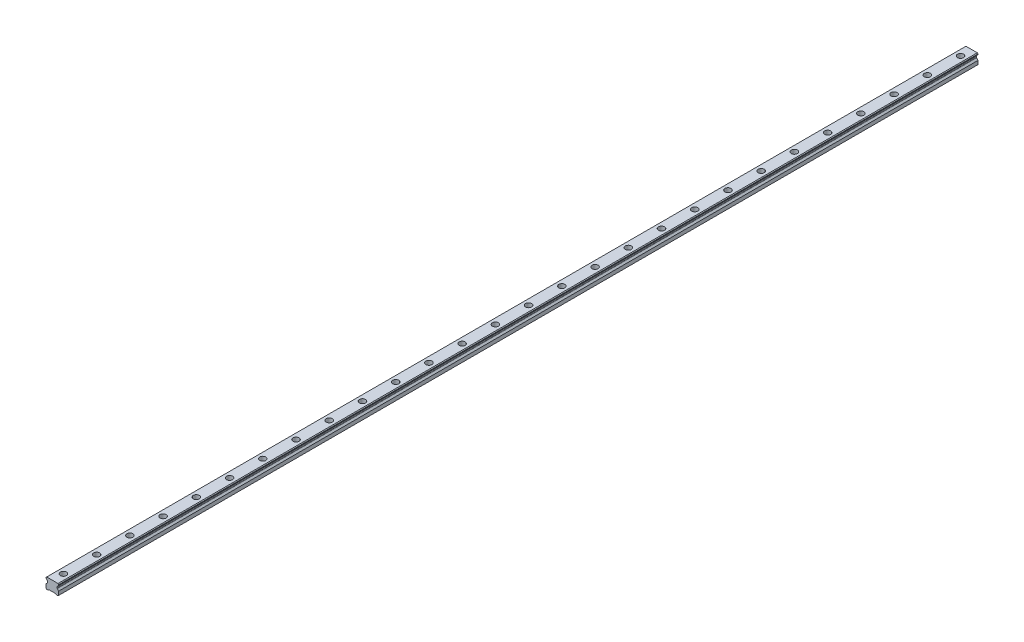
ISO-10303-21;
HEADER;
FILE_DESCRIPTION(('STEP AP214'),'2;1');
FILE_NAME('part.step','',(''),(''),'','','');
FILE_SCHEMA(('AUTOMOTIVE_DESIGN { 1 0 10303 214 1 1 1 1 }'));
ENDSEC;
DATA;
#1=APPLICATION_CONTEXT('core data for automotive mechanical design processes');
#2=APPLICATION_PROTOCOL_DEFINITION('international standard','automotive_design',2000,#1);
#3=PRODUCT_CONTEXT('',#1,'mechanical');
#4=PRODUCT('Part','Part','',(#3));
#5=PRODUCT_RELATED_PRODUCT_CATEGORY('part','',(#4));
#6=PRODUCT_DEFINITION_FORMATION('','',#4);
#7=PRODUCT_DEFINITION_CONTEXT('part definition',#1,'design');
#8=PRODUCT_DEFINITION('design','',#6,#7);
#9=PRODUCT_DEFINITION_SHAPE('','',#8);
#10=(LENGTH_UNIT() NAMED_UNIT(*) SI_UNIT(.MILLI.,.METRE.));
#11=(NAMED_UNIT(*) PLANE_ANGLE_UNIT() SI_UNIT($,.RADIAN.));
#12=(NAMED_UNIT(*) SI_UNIT($,.STERADIAN.) SOLID_ANGLE_UNIT());
#13=UNCERTAINTY_MEASURE_WITH_UNIT(LENGTH_MEASURE(1.E-05),#10,'distance_accuracy_value','');
#14=(GEOMETRIC_REPRESENTATION_CONTEXT(3) GLOBAL_UNCERTAINTY_ASSIGNED_CONTEXT((#13)) GLOBAL_UNIT_ASSIGNED_CONTEXT((#10,
#11,#12)) REPRESENTATION_CONTEXT('',''));
#15=CARTESIAN_POINT('',(0.,0.,0.));
#16=DIRECTION('',(0.,0.,1.));
#17=DIRECTION('',(1.,0.,0.));
#18=AXIS2_PLACEMENT_3D('',#15,#16,#17);
#19=CARTESIAN_POINT('',(0.,10.2,-810.));
#20=DIRECTION('',(0.,1.,0.));
#21=DIRECTION('',(0.,0.,1.));
#22=AXIS2_PLACEMENT_3D('',#19,#20,#21);
#23=PLANE('',#22);
#24=CARTESIAN_POINT('',(0.,10.2,-810.));
#25=DIRECTION('',(0.,1.,0.));
#26=DIRECTION('',(0.,0.,1.));
#27=AXIS2_PLACEMENT_3D('',#24,#25,#26);
#28=CIRCLE('',#27,3.5);
#29=CARTESIAN_POINT('',(0.,10.2,-806.5));
#30=VERTEX_POINT('',#29);
#31=EDGE_CURVE('E566',#30,#30,#28,.T.);
#32=ORIENTED_EDGE('',*,*,#31,.F.);
#33=EDGE_LOOP('',(#32));
#34=FACE_BOUND('',#33,.T.);
#35=CARTESIAN_POINT('',(0.,10.2,-810.));
#36=DIRECTION('',(0.,1.,0.));
#37=DIRECTION('',(0.,0.,1.));
#38=AXIS2_PLACEMENT_3D('',#35,#36,#37);
#39=CIRCLE('',#38,5.5);
#40=CARTESIAN_POINT('',(0.,10.2,-804.5));
#41=VERTEX_POINT('',#40);
#42=EDGE_CURVE('E11',#41,#41,#39,.T.);
#43=ORIENTED_EDGE('',*,*,#42,.T.);
#44=EDGE_LOOP('',(#43));
#45=FACE_BOUND('',#44,.T.);
#46=ADVANCED_FACE('F39',(#34,#45),#23,.T.);
#47=CARTESIAN_POINT('',(0.,10.2,-810.));
#48=DIRECTION('',(0.,1.,0.));
#49=DIRECTION('',(0.,0.,1.));
#50=AXIS2_PLACEMENT_3D('',#47,#48,#49);
#51=CYLINDRICAL_SURFACE('',#50,5.5);
#52=ORIENTED_EDGE('',*,*,#42,.F.);
#53=EDGE_LOOP('',(#52));
#54=FACE_BOUND('',#53,.T.);
#55=CARTESIAN_POINT('',(0.,19.2,-810.));
#56=DIRECTION('',(0.,1.,0.));
#57=DIRECTION('',(0.,0.,1.));
#58=AXIS2_PLACEMENT_3D('',#55,#56,#57);
#59=CIRCLE('',#58,5.5);
#60=CARTESIAN_POINT('',(0.,19.2,-804.5));
#61=VERTEX_POINT('',#60);
#62=EDGE_CURVE('E48',#61,#61,#59,.T.);
#63=ORIENTED_EDGE('',*,*,#62,.T.);
#64=EDGE_LOOP('',(#63));
#65=FACE_BOUND('',#64,.T.);
#66=ADVANCED_FACE('F985',(#54,#65),#51,.F.);
#67=CARTESIAN_POINT('',(0.,10.2,-750.));
#68=DIRECTION('',(0.,1.,0.));
#69=DIRECTION('',(0.,0.,1.));
#70=AXIS2_PLACEMENT_3D('',#67,#68,#69);
#71=PLANE('',#70);
#72=CARTESIAN_POINT('',(0.,10.2,-750.));
#73=DIRECTION('',(0.,1.,0.));
#74=DIRECTION('',(0.,0.,1.));
#75=AXIS2_PLACEMENT_3D('',#72,#73,#74);
#76=CIRCLE('',#75,3.5);
#77=CARTESIAN_POINT('',(0.,10.2,-746.5));
#78=VERTEX_POINT('',#77);
#79=EDGE_CURVE('E571',#78,#78,#76,.T.);
#80=ORIENTED_EDGE('',*,*,#79,.F.);
#81=EDGE_LOOP('',(#80));
#82=FACE_BOUND('',#81,.T.);
#83=CARTESIAN_POINT('',(0.,10.2,-750.));
#84=DIRECTION('',(0.,1.,0.));
#85=DIRECTION('',(0.,0.,1.));
#86=AXIS2_PLACEMENT_3D('',#83,#84,#85);
#87=CIRCLE('',#86,5.5);
#88=CARTESIAN_POINT('',(0.,10.2,-744.5));
#89=VERTEX_POINT('',#88);
#90=EDGE_CURVE('E550',#89,#89,#87,.T.);
#91=ORIENTED_EDGE('',*,*,#90,.T.);
#92=EDGE_LOOP('',(#91));
#93=FACE_BOUND('',#92,.T.);
#94=ADVANCED_FACE('F987',(#82,#93),#71,.T.);
#95=CARTESIAN_POINT('',(0.,10.2,-750.));
#96=DIRECTION('',(0.,1.,0.));
#97=DIRECTION('',(0.,0.,1.));
#98=AXIS2_PLACEMENT_3D('',#95,#96,#97);
#99=CYLINDRICAL_SURFACE('',#98,5.5);
#100=ORIENTED_EDGE('',*,*,#90,.F.);
#101=EDGE_LOOP('',(#100));
#102=FACE_BOUND('',#101,.T.);
#103=CARTESIAN_POINT('',(0.,19.2,-750.));
#104=DIRECTION('',(0.,1.,0.));
#105=DIRECTION('',(0.,0.,1.));
#106=AXIS2_PLACEMENT_3D('',#103,#104,#105);
#107=CIRCLE('',#106,5.5);
#108=CARTESIAN_POINT('',(0.,19.2,-744.5));
#109=VERTEX_POINT('',#108);
#110=EDGE_CURVE('E546',#109,#109,#107,.T.);
#111=ORIENTED_EDGE('',*,*,#110,.T.);
#112=EDGE_LOOP('',(#111));
#113=FACE_BOUND('',#112,.T.);
#114=ADVANCED_FACE('F993',(#102,#113),#99,.F.);
#115=CARTESIAN_POINT('',(0.,10.2,-690.));
#116=DIRECTION('',(0.,1.,0.));
#117=DIRECTION('',(0.,0.,1.));
#118=AXIS2_PLACEMENT_3D('',#115,#116,#117);
#119=PLANE('',#118);
#120=CARTESIAN_POINT('',(0.,10.2,-690.));
#121=DIRECTION('',(0.,1.,0.));
#122=DIRECTION('',(0.,0.,1.));
#123=AXIS2_PLACEMENT_3D('',#120,#121,#122);
#124=CIRCLE('',#123,3.5);
#125=CARTESIAN_POINT('',(0.,10.2,-686.5));
#126=VERTEX_POINT('',#125);
#127=EDGE_CURVE('E576',#126,#126,#124,.T.);
#128=ORIENTED_EDGE('',*,*,#127,.F.);
#129=EDGE_LOOP('',(#128));
#130=FACE_BOUND('',#129,.T.);
#131=CARTESIAN_POINT('',(0.,10.2,-690.));
#132=DIRECTION('',(0.,1.,0.));
#133=DIRECTION('',(0.,0.,1.));
#134=AXIS2_PLACEMENT_3D('',#131,#132,#133);
#135=CIRCLE('',#134,5.5);
#136=CARTESIAN_POINT('',(0.,10.2,-684.5));
#137=VERTEX_POINT('',#136);
#138=EDGE_CURVE('E542',#137,#137,#135,.T.);
#139=ORIENTED_EDGE('',*,*,#138,.T.);
#140=EDGE_LOOP('',(#139));
#141=FACE_BOUND('',#140,.T.);
#142=ADVANCED_FACE('F1001',(#130,#141),#119,.T.);
#143=CARTESIAN_POINT('',(0.,10.2,-690.));
#144=DIRECTION('',(0.,1.,0.));
#145=DIRECTION('',(0.,0.,1.));
#146=AXIS2_PLACEMENT_3D('',#143,#144,#145);
#147=CYLINDRICAL_SURFACE('',#146,5.5);
#148=ORIENTED_EDGE('',*,*,#138,.F.);
#149=EDGE_LOOP('',(#148));
#150=FACE_BOUND('',#149,.T.);
#151=CARTESIAN_POINT('',(0.,19.2,-690.));
#152=DIRECTION('',(0.,1.,0.));
#153=DIRECTION('',(0.,0.,1.));
#154=AXIS2_PLACEMENT_3D('',#151,#152,#153);
#155=CIRCLE('',#154,5.5);
#156=CARTESIAN_POINT('',(0.,19.2,-684.5));
#157=VERTEX_POINT('',#156);
#158=EDGE_CURVE('E538',#157,#157,#155,.T.);
#159=ORIENTED_EDGE('',*,*,#158,.T.);
#160=EDGE_LOOP('',(#159));
#161=FACE_BOUND('',#160,.T.);
#162=ADVANCED_FACE('F1005',(#150,#161),#147,.F.);
#163=CARTESIAN_POINT('',(0.,10.2,-630.));
#164=DIRECTION('',(0.,1.,0.));
#165=DIRECTION('',(0.,0.,1.));
#166=AXIS2_PLACEMENT_3D('',#163,#164,#165);
#167=PLANE('',#166);
#168=CARTESIAN_POINT('',(0.,10.2,-630.));
#169=DIRECTION('',(0.,1.,0.));
#170=DIRECTION('',(0.,0.,1.));
#171=AXIS2_PLACEMENT_3D('',#168,#169,#170);
#172=CIRCLE('',#171,3.5);
#173=CARTESIAN_POINT('',(0.,10.2,-626.5));
#174=VERTEX_POINT('',#173);
#175=EDGE_CURVE('E581',#174,#174,#172,.T.);
#176=ORIENTED_EDGE('',*,*,#175,.F.);
#177=EDGE_LOOP('',(#176));
#178=FACE_BOUND('',#177,.T.);
#179=CARTESIAN_POINT('',(0.,10.2,-630.));
#180=DIRECTION('',(0.,1.,0.));
#181=DIRECTION('',(0.,0.,1.));
#182=AXIS2_PLACEMENT_3D('',#179,#180,#181);
#183=CIRCLE('',#182,5.5);
#184=CARTESIAN_POINT('',(0.,10.2,-624.5));
#185=VERTEX_POINT('',#184);
#186=EDGE_CURVE('E534',#185,#185,#183,.T.);
#187=ORIENTED_EDGE('',*,*,#186,.T.);
#188=EDGE_LOOP('',(#187));
#189=FACE_BOUND('',#188,.T.);
#190=ADVANCED_FACE('F1009',(#178,#189),#167,.T.);
#191=CARTESIAN_POINT('',(0.,10.2,-630.));
#192=DIRECTION('',(0.,1.,0.));
#193=DIRECTION('',(0.,0.,1.));
#194=AXIS2_PLACEMENT_3D('',#191,#192,#193);
#195=CYLINDRICAL_SURFACE('',#194,5.5);
#196=ORIENTED_EDGE('',*,*,#186,.F.);
#197=EDGE_LOOP('',(#196));
#198=FACE_BOUND('',#197,.T.);
#199=CARTESIAN_POINT('',(0.,19.2,-630.));
#200=DIRECTION('',(0.,1.,0.));
#201=DIRECTION('',(0.,0.,1.));
#202=AXIS2_PLACEMENT_3D('',#199,#200,#201);
#203=CIRCLE('',#202,5.5);
#204=CARTESIAN_POINT('',(0.,19.2,-624.5));
#205=VERTEX_POINT('',#204);
#206=EDGE_CURVE('E530',#205,#205,#203,.T.);
#207=ORIENTED_EDGE('',*,*,#206,.T.);
#208=EDGE_LOOP('',(#207));
#209=FACE_BOUND('',#208,.T.);
#210=ADVANCED_FACE('F1013',(#198,#209),#195,.F.);
#211=CARTESIAN_POINT('',(0.,10.2,-570.));
#212=DIRECTION('',(0.,1.,0.));
#213=DIRECTION('',(0.,0.,1.));
#214=AXIS2_PLACEMENT_3D('',#211,#212,#213);
#215=PLANE('',#214);
#216=CARTESIAN_POINT('',(0.,10.2,-570.));
#217=DIRECTION('',(0.,1.,0.));
#218=DIRECTION('',(0.,0.,1.));
#219=AXIS2_PLACEMENT_3D('',#216,#217,#218);
#220=CIRCLE('',#219,3.5);
#221=CARTESIAN_POINT('',(0.,10.2,-566.5));
#222=VERTEX_POINT('',#221);
#223=EDGE_CURVE('E586',#222,#222,#220,.T.);
#224=ORIENTED_EDGE('',*,*,#223,.F.);
#225=EDGE_LOOP('',(#224));
#226=FACE_BOUND('',#225,.T.);
#227=CARTESIAN_POINT('',(0.,10.2,-570.));
#228=DIRECTION('',(0.,1.,0.));
#229=DIRECTION('',(0.,0.,1.));
#230=AXIS2_PLACEMENT_3D('',#227,#228,#229);
#231=CIRCLE('',#230,5.5);
#232=CARTESIAN_POINT('',(0.,10.2,-564.5));
#233=VERTEX_POINT('',#232);
#234=EDGE_CURVE('E526',#233,#233,#231,.T.);
#235=ORIENTED_EDGE('',*,*,#234,.T.);
#236=EDGE_LOOP('',(#235));
#237=FACE_BOUND('',#236,.T.);
#238=ADVANCED_FACE('F1017',(#226,#237),#215,.T.);
#239=CARTESIAN_POINT('',(0.,10.2,-570.));
#240=DIRECTION('',(0.,1.,0.));
#241=DIRECTION('',(0.,0.,1.));
#242=AXIS2_PLACEMENT_3D('',#239,#240,#241);
#243=CYLINDRICAL_SURFACE('',#242,5.5);
#244=ORIENTED_EDGE('',*,*,#234,.F.);
#245=EDGE_LOOP('',(#244));
#246=FACE_BOUND('',#245,.T.);
#247=CARTESIAN_POINT('',(0.,19.2,-570.));
#248=DIRECTION('',(0.,1.,0.));
#249=DIRECTION('',(0.,0.,1.));
#250=AXIS2_PLACEMENT_3D('',#247,#248,#249);
#251=CIRCLE('',#250,5.5);
#252=CARTESIAN_POINT('',(0.,19.2,-564.5));
#253=VERTEX_POINT('',#252);
#254=EDGE_CURVE('E522',#253,#253,#251,.T.);
#255=ORIENTED_EDGE('',*,*,#254,.T.);
#256=EDGE_LOOP('',(#255));
#257=FACE_BOUND('',#256,.T.);
#258=ADVANCED_FACE('F1021',(#246,#257),#243,.F.);
#259=CARTESIAN_POINT('',(0.,10.2,-510.));
#260=DIRECTION('',(0.,1.,0.));
#261=DIRECTION('',(0.,0.,1.));
#262=AXIS2_PLACEMENT_3D('',#259,#260,#261);
#263=PLANE('',#262);
#264=CARTESIAN_POINT('',(0.,10.2,-510.));
#265=DIRECTION('',(0.,1.,0.));
#266=DIRECTION('',(0.,0.,1.));
#267=AXIS2_PLACEMENT_3D('',#264,#265,#266);
#268=CIRCLE('',#267,3.5);
#269=CARTESIAN_POINT('',(0.,10.2,-506.5));
#270=VERTEX_POINT('',#269);
#271=EDGE_CURVE('E591',#270,#270,#268,.T.);
#272=ORIENTED_EDGE('',*,*,#271,.F.);
#273=EDGE_LOOP('',(#272));
#274=FACE_BOUND('',#273,.T.);
#275=CARTESIAN_POINT('',(0.,10.2,-510.));
#276=DIRECTION('',(0.,1.,0.));
#277=DIRECTION('',(0.,0.,1.));
#278=AXIS2_PLACEMENT_3D('',#275,#276,#277);
#279=CIRCLE('',#278,5.5);
#280=CARTESIAN_POINT('',(0.,10.2,-504.5));
#281=VERTEX_POINT('',#280);
#282=EDGE_CURVE('E518',#281,#281,#279,.T.);
#283=ORIENTED_EDGE('',*,*,#282,.T.);
#284=EDGE_LOOP('',(#283));
#285=FACE_BOUND('',#284,.T.);
#286=ADVANCED_FACE('F1025',(#274,#285),#263,.T.);
#287=CARTESIAN_POINT('',(0.,10.2,-510.));
#288=DIRECTION('',(0.,1.,0.));
#289=DIRECTION('',(0.,0.,1.));
#290=AXIS2_PLACEMENT_3D('',#287,#288,#289);
#291=CYLINDRICAL_SURFACE('',#290,5.5);
#292=ORIENTED_EDGE('',*,*,#282,.F.);
#293=EDGE_LOOP('',(#292));
#294=FACE_BOUND('',#293,.T.);
#295=CARTESIAN_POINT('',(0.,19.2,-510.));
#296=DIRECTION('',(0.,1.,0.));
#297=DIRECTION('',(0.,0.,1.));
#298=AXIS2_PLACEMENT_3D('',#295,#296,#297);
#299=CIRCLE('',#298,5.5);
#300=CARTESIAN_POINT('',(0.,19.2,-504.5));
#301=VERTEX_POINT('',#300);
#302=EDGE_CURVE('E514',#301,#301,#299,.T.);
#303=ORIENTED_EDGE('',*,*,#302,.T.);
#304=EDGE_LOOP('',(#303));
#305=FACE_BOUND('',#304,.T.);
#306=ADVANCED_FACE('F1029',(#294,#305),#291,.F.);
#307=CARTESIAN_POINT('',(0.,10.2,-450.));
#308=DIRECTION('',(0.,1.,0.));
#309=DIRECTION('',(0.,0.,1.));
#310=AXIS2_PLACEMENT_3D('',#307,#308,#309);
#311=PLANE('',#310);
#312=CARTESIAN_POINT('',(0.,10.2,-450.));
#313=DIRECTION('',(0.,1.,0.));
#314=DIRECTION('',(0.,0.,1.));
#315=AXIS2_PLACEMENT_3D('',#312,#313,#314);
#316=CIRCLE('',#315,3.5);
#317=CARTESIAN_POINT('',(0.,10.2,-446.5));
#318=VERTEX_POINT('',#317);
#319=EDGE_CURVE('E596',#318,#318,#316,.T.);
#320=ORIENTED_EDGE('',*,*,#319,.F.);
#321=EDGE_LOOP('',(#320));
#322=FACE_BOUND('',#321,.T.);
#323=CARTESIAN_POINT('',(0.,10.2,-450.));
#324=DIRECTION('',(0.,1.,0.));
#325=DIRECTION('',(0.,0.,1.));
#326=AXIS2_PLACEMENT_3D('',#323,#324,#325);
#327=CIRCLE('',#326,5.5);
#328=CARTESIAN_POINT('',(0.,10.2,-444.5));
#329=VERTEX_POINT('',#328);
#330=EDGE_CURVE('E510',#329,#329,#327,.T.);
#331=ORIENTED_EDGE('',*,*,#330,.T.);
#332=EDGE_LOOP('',(#331));
#333=FACE_BOUND('',#332,.T.);
#334=ADVANCED_FACE('F1033',(#322,#333),#311,.T.);
#335=CARTESIAN_POINT('',(0.,10.2,-450.));
#336=DIRECTION('',(0.,1.,0.));
#337=DIRECTION('',(0.,0.,1.));
#338=AXIS2_PLACEMENT_3D('',#335,#336,#337);
#339=CYLINDRICAL_SURFACE('',#338,5.5);
#340=ORIENTED_EDGE('',*,*,#330,.F.);
#341=EDGE_LOOP('',(#340));
#342=FACE_BOUND('',#341,.T.);
#343=CARTESIAN_POINT('',(0.,19.2,-450.));
#344=DIRECTION('',(0.,1.,0.));
#345=DIRECTION('',(0.,0.,1.));
#346=AXIS2_PLACEMENT_3D('',#343,#344,#345);
#347=CIRCLE('',#346,5.5);
#348=CARTESIAN_POINT('',(0.,19.2,-444.5));
#349=VERTEX_POINT('',#348);
#350=EDGE_CURVE('E506',#349,#349,#347,.T.);
#351=ORIENTED_EDGE('',*,*,#350,.T.);
#352=EDGE_LOOP('',(#351));
#353=FACE_BOUND('',#352,.T.);
#354=ADVANCED_FACE('F1037',(#342,#353),#339,.F.);
#355=CARTESIAN_POINT('',(0.,10.2,-390.));
#356=DIRECTION('',(0.,1.,0.));
#357=DIRECTION('',(0.,0.,1.));
#358=AXIS2_PLACEMENT_3D('',#355,#356,#357);
#359=PLANE('',#358);
#360=CARTESIAN_POINT('',(0.,10.2,-390.));
#361=DIRECTION('',(0.,1.,0.));
#362=DIRECTION('',(0.,0.,1.));
#363=AXIS2_PLACEMENT_3D('',#360,#361,#362);
#364=CIRCLE('',#363,3.5);
#365=CARTESIAN_POINT('',(0.,10.2,-386.5));
#366=VERTEX_POINT('',#365);
#367=EDGE_CURVE('E601',#366,#366,#364,.T.);
#368=ORIENTED_EDGE('',*,*,#367,.F.);
#369=EDGE_LOOP('',(#368));
#370=FACE_BOUND('',#369,.T.);
#371=CARTESIAN_POINT('',(0.,10.2,-390.));
#372=DIRECTION('',(0.,1.,0.));
#373=DIRECTION('',(0.,0.,1.));
#374=AXIS2_PLACEMENT_3D('',#371,#372,#373);
#375=CIRCLE('',#374,5.5);
#376=CARTESIAN_POINT('',(0.,10.2,-384.5));
#377=VERTEX_POINT('',#376);
#378=EDGE_CURVE('E502',#377,#377,#375,.T.);
#379=ORIENTED_EDGE('',*,*,#378,.T.);
#380=EDGE_LOOP('',(#379));
#381=FACE_BOUND('',#380,.T.);
#382=ADVANCED_FACE('F1041',(#370,#381),#359,.T.);
#383=CARTESIAN_POINT('',(0.,10.2,-390.));
#384=DIRECTION('',(0.,1.,0.));
#385=DIRECTION('',(0.,0.,1.));
#386=AXIS2_PLACEMENT_3D('',#383,#384,#385);
#387=CYLINDRICAL_SURFACE('',#386,5.5);
#388=ORIENTED_EDGE('',*,*,#378,.F.);
#389=EDGE_LOOP('',(#388));
#390=FACE_BOUND('',#389,.T.);
#391=CARTESIAN_POINT('',(0.,19.2,-390.));
#392=DIRECTION('',(0.,1.,0.));
#393=DIRECTION('',(0.,0.,1.));
#394=AXIS2_PLACEMENT_3D('',#391,#392,#393);
#395=CIRCLE('',#394,5.5);
#396=CARTESIAN_POINT('',(0.,19.2,-384.5));
#397=VERTEX_POINT('',#396);
#398=EDGE_CURVE('E498',#397,#397,#395,.T.);
#399=ORIENTED_EDGE('',*,*,#398,.T.);
#400=EDGE_LOOP('',(#399));
#401=FACE_BOUND('',#400,.T.);
#402=ADVANCED_FACE('F1045',(#390,#401),#387,.F.);
#403=CARTESIAN_POINT('',(0.,10.2,-330.));
#404=DIRECTION('',(0.,1.,0.));
#405=DIRECTION('',(0.,0.,1.));
#406=AXIS2_PLACEMENT_3D('',#403,#404,#405);
#407=PLANE('',#406);
#408=CARTESIAN_POINT('',(0.,10.2,-330.));
#409=DIRECTION('',(0.,1.,0.));
#410=DIRECTION('',(0.,0.,1.));
#411=AXIS2_PLACEMENT_3D('',#408,#409,#410);
#412=CIRCLE('',#411,3.5);
#413=CARTESIAN_POINT('',(0.,10.2,-326.5));
#414=VERTEX_POINT('',#413);
#415=EDGE_CURVE('E606',#414,#414,#412,.T.);
#416=ORIENTED_EDGE('',*,*,#415,.F.);
#417=EDGE_LOOP('',(#416));
#418=FACE_BOUND('',#417,.T.);
#419=CARTESIAN_POINT('',(0.,10.2,-330.));
#420=DIRECTION('',(0.,1.,0.));
#421=DIRECTION('',(0.,0.,1.));
#422=AXIS2_PLACEMENT_3D('',#419,#420,#421);
#423=CIRCLE('',#422,5.5);
#424=CARTESIAN_POINT('',(0.,10.2,-324.5));
#425=VERTEX_POINT('',#424);
#426=EDGE_CURVE('E494',#425,#425,#423,.T.);
#427=ORIENTED_EDGE('',*,*,#426,.T.);
#428=EDGE_LOOP('',(#427));
#429=FACE_BOUND('',#428,.T.);
#430=ADVANCED_FACE('F1049',(#418,#429),#407,.T.);
#431=CARTESIAN_POINT('',(0.,10.2,-330.));
#432=DIRECTION('',(0.,1.,0.));
#433=DIRECTION('',(0.,0.,1.));
#434=AXIS2_PLACEMENT_3D('',#431,#432,#433);
#435=CYLINDRICAL_SURFACE('',#434,5.5);
#436=ORIENTED_EDGE('',*,*,#426,.F.);
#437=EDGE_LOOP('',(#436));
#438=FACE_BOUND('',#437,.T.);
#439=CARTESIAN_POINT('',(0.,19.2,-330.));
#440=DIRECTION('',(0.,1.,0.));
#441=DIRECTION('',(0.,0.,1.));
#442=AXIS2_PLACEMENT_3D('',#439,#440,#441);
#443=CIRCLE('',#442,5.5);
#444=CARTESIAN_POINT('',(0.,19.2,-324.5));
#445=VERTEX_POINT('',#444);
#446=EDGE_CURVE('E490',#445,#445,#443,.T.);
#447=ORIENTED_EDGE('',*,*,#446,.T.);
#448=EDGE_LOOP('',(#447));
#449=FACE_BOUND('',#448,.T.);
#450=ADVANCED_FACE('F1053',(#438,#449),#435,.F.);
#451=CARTESIAN_POINT('',(0.,10.2,-270.));
#452=DIRECTION('',(0.,1.,0.));
#453=DIRECTION('',(0.,0.,1.));
#454=AXIS2_PLACEMENT_3D('',#451,#452,#453);
#455=PLANE('',#454);
#456=CARTESIAN_POINT('',(0.,10.2,-270.));
#457=DIRECTION('',(0.,1.,0.));
#458=DIRECTION('',(0.,0.,1.));
#459=AXIS2_PLACEMENT_3D('',#456,#457,#458);
#460=CIRCLE('',#459,3.5);
#461=CARTESIAN_POINT('',(0.,10.2,-266.5));
#462=VERTEX_POINT('',#461);
#463=EDGE_CURVE('E611',#462,#462,#460,.T.);
#464=ORIENTED_EDGE('',*,*,#463,.F.);
#465=EDGE_LOOP('',(#464));
#466=FACE_BOUND('',#465,.T.);
#467=CARTESIAN_POINT('',(0.,10.2,-270.));
#468=DIRECTION('',(0.,1.,0.));
#469=DIRECTION('',(0.,0.,1.));
#470=AXIS2_PLACEMENT_3D('',#467,#468,#469);
#471=CIRCLE('',#470,5.5);
#472=CARTESIAN_POINT('',(0.,10.2,-264.5));
#473=VERTEX_POINT('',#472);
#474=EDGE_CURVE('E486',#473,#473,#471,.T.);
#475=ORIENTED_EDGE('',*,*,#474,.T.);
#476=EDGE_LOOP('',(#475));
#477=FACE_BOUND('',#476,.T.);
#478=ADVANCED_FACE('F1057',(#466,#477),#455,.T.);
#479=CARTESIAN_POINT('',(0.,10.2,-270.));
#480=DIRECTION('',(0.,1.,0.));
#481=DIRECTION('',(0.,0.,1.));
#482=AXIS2_PLACEMENT_3D('',#479,#480,#481);
#483=CYLINDRICAL_SURFACE('',#482,5.5);
#484=ORIENTED_EDGE('',*,*,#474,.F.);
#485=EDGE_LOOP('',(#484));
#486=FACE_BOUND('',#485,.T.);
#487=CARTESIAN_POINT('',(0.,19.2,-270.));
#488=DIRECTION('',(0.,1.,0.));
#489=DIRECTION('',(0.,0.,1.));
#490=AXIS2_PLACEMENT_3D('',#487,#488,#489);
#491=CIRCLE('',#490,5.5);
#492=CARTESIAN_POINT('',(0.,19.2,-264.5));
#493=VERTEX_POINT('',#492);
#494=EDGE_CURVE('E482',#493,#493,#491,.T.);
#495=ORIENTED_EDGE('',*,*,#494,.T.);
#496=EDGE_LOOP('',(#495));
#497=FACE_BOUND('',#496,.T.);
#498=ADVANCED_FACE('F1061',(#486,#497),#483,.F.);
#499=CARTESIAN_POINT('',(0.,10.2,-210.));
#500=DIRECTION('',(0.,1.,0.));
#501=DIRECTION('',(0.,0.,1.));
#502=AXIS2_PLACEMENT_3D('',#499,#500,#501);
#503=PLANE('',#502);
#504=CARTESIAN_POINT('',(0.,10.2,-210.));
#505=DIRECTION('',(0.,1.,0.));
#506=DIRECTION('',(0.,0.,1.));
#507=AXIS2_PLACEMENT_3D('',#504,#505,#506);
#508=CIRCLE('',#507,3.5);
#509=CARTESIAN_POINT('',(0.,10.2,-206.5));
#510=VERTEX_POINT('',#509);
#511=EDGE_CURVE('E616',#510,#510,#508,.T.);
#512=ORIENTED_EDGE('',*,*,#511,.F.);
#513=EDGE_LOOP('',(#512));
#514=FACE_BOUND('',#513,.T.);
#515=CARTESIAN_POINT('',(0.,10.2,-210.));
#516=DIRECTION('',(0.,1.,0.));
#517=DIRECTION('',(0.,0.,1.));
#518=AXIS2_PLACEMENT_3D('',#515,#516,#517);
#519=CIRCLE('',#518,5.5);
#520=CARTESIAN_POINT('',(0.,10.2,-204.5));
#521=VERTEX_POINT('',#520);
#522=EDGE_CURVE('E478',#521,#521,#519,.T.);
#523=ORIENTED_EDGE('',*,*,#522,.T.);
#524=EDGE_LOOP('',(#523));
#525=FACE_BOUND('',#524,.T.);
#526=ADVANCED_FACE('F1065',(#514,#525),#503,.T.);
#527=CARTESIAN_POINT('',(0.,10.2,-210.));
#528=DIRECTION('',(0.,1.,0.));
#529=DIRECTION('',(0.,0.,1.));
#530=AXIS2_PLACEMENT_3D('',#527,#528,#529);
#531=CYLINDRICAL_SURFACE('',#530,5.5);
#532=ORIENTED_EDGE('',*,*,#522,.F.);
#533=EDGE_LOOP('',(#532));
#534=FACE_BOUND('',#533,.T.);
#535=CARTESIAN_POINT('',(0.,19.2,-210.));
#536=DIRECTION('',(0.,1.,0.));
#537=DIRECTION('',(0.,0.,1.));
#538=AXIS2_PLACEMENT_3D('',#535,#536,#537);
#539=CIRCLE('',#538,5.5);
#540=CARTESIAN_POINT('',(0.,19.2,-204.5));
#541=VERTEX_POINT('',#540);
#542=EDGE_CURVE('E474',#541,#541,#539,.T.);
#543=ORIENTED_EDGE('',*,*,#542,.T.);
#544=EDGE_LOOP('',(#543));
#545=FACE_BOUND('',#544,.T.);
#546=ADVANCED_FACE('F1069',(#534,#545),#531,.F.);
#547=CARTESIAN_POINT('',(0.,10.2,-150.));
#548=DIRECTION('',(0.,1.,0.));
#549=DIRECTION('',(0.,0.,1.));
#550=AXIS2_PLACEMENT_3D('',#547,#548,#549);
#551=PLANE('',#550);
#552=CARTESIAN_POINT('',(0.,10.2,-150.));
#553=DIRECTION('',(0.,1.,0.));
#554=DIRECTION('',(0.,0.,1.));
#555=AXIS2_PLACEMENT_3D('',#552,#553,#554);
#556=CIRCLE('',#555,3.5);
#557=CARTESIAN_POINT('',(0.,10.2,-146.5));
#558=VERTEX_POINT('',#557);
#559=EDGE_CURVE('E621',#558,#558,#556,.T.);
#560=ORIENTED_EDGE('',*,*,#559,.F.);
#561=EDGE_LOOP('',(#560));
#562=FACE_BOUND('',#561,.T.);
#563=CARTESIAN_POINT('',(0.,10.2,-150.));
#564=DIRECTION('',(0.,1.,0.));
#565=DIRECTION('',(0.,0.,1.));
#566=AXIS2_PLACEMENT_3D('',#563,#564,#565);
#567=CIRCLE('',#566,5.5);
#568=CARTESIAN_POINT('',(0.,10.2,-144.5));
#569=VERTEX_POINT('',#568);
#570=EDGE_CURVE('E470',#569,#569,#567,.T.);
#571=ORIENTED_EDGE('',*,*,#570,.T.);
#572=EDGE_LOOP('',(#571));
#573=FACE_BOUND('',#572,.T.);
#574=ADVANCED_FACE('F1073',(#562,#573),#551,.T.);
#575=CARTESIAN_POINT('',(0.,10.2,-150.));
#576=DIRECTION('',(0.,1.,0.));
#577=DIRECTION('',(0.,0.,1.));
#578=AXIS2_PLACEMENT_3D('',#575,#576,#577);
#579=CYLINDRICAL_SURFACE('',#578,5.5);
#580=ORIENTED_EDGE('',*,*,#570,.F.);
#581=EDGE_LOOP('',(#580));
#582=FACE_BOUND('',#581,.T.);
#583=CARTESIAN_POINT('',(0.,19.2,-150.));
#584=DIRECTION('',(0.,1.,0.));
#585=DIRECTION('',(0.,0.,1.));
#586=AXIS2_PLACEMENT_3D('',#583,#584,#585);
#587=CIRCLE('',#586,5.5);
#588=CARTESIAN_POINT('',(0.,19.2,-144.5));
#589=VERTEX_POINT('',#588);
#590=EDGE_CURVE('E466',#589,#589,#587,.T.);
#591=ORIENTED_EDGE('',*,*,#590,.T.);
#592=EDGE_LOOP('',(#591));
#593=FACE_BOUND('',#592,.T.);
#594=ADVANCED_FACE('F1077',(#582,#593),#579,.F.);
#595=CARTESIAN_POINT('',(0.,10.2,-89.9999999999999));
#596=DIRECTION('',(0.,1.,0.));
#597=DIRECTION('',(0.,0.,1.));
#598=AXIS2_PLACEMENT_3D('',#595,#596,#597);
#599=PLANE('',#598);
#600=CARTESIAN_POINT('',(0.,10.2,-90.));
#601=DIRECTION('',(0.,1.,0.));
#602=DIRECTION('',(0.,0.,1.));
#603=AXIS2_PLACEMENT_3D('',#600,#601,#602);
#604=CIRCLE('',#603,3.5);
#605=CARTESIAN_POINT('',(0.,10.2,-86.5));
#606=VERTEX_POINT('',#605);
#607=EDGE_CURVE('E626',#606,#606,#604,.T.);
#608=ORIENTED_EDGE('',*,*,#607,.F.);
#609=EDGE_LOOP('',(#608));
#610=FACE_BOUND('',#609,.T.);
#611=CARTESIAN_POINT('',(0.,10.2,-89.9999999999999));
#612=DIRECTION('',(0.,1.,0.));
#613=DIRECTION('',(0.,0.,1.));
#614=AXIS2_PLACEMENT_3D('',#611,#612,#613);
#615=CIRCLE('',#614,5.5);
#616=CARTESIAN_POINT('',(0.,10.2,-84.4999999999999));
#617=VERTEX_POINT('',#616);
#618=EDGE_CURVE('E462',#617,#617,#615,.T.);
#619=ORIENTED_EDGE('',*,*,#618,.T.);
#620=EDGE_LOOP('',(#619));
#621=FACE_BOUND('',#620,.T.);
#622=ADVANCED_FACE('F1081',(#610,#621),#599,.T.);
#623=CARTESIAN_POINT('',(0.,10.2,-89.9999999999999));
#624=DIRECTION('',(0.,1.,0.));
#625=DIRECTION('',(0.,0.,1.));
#626=AXIS2_PLACEMENT_3D('',#623,#624,#625);
#627=CYLINDRICAL_SURFACE('',#626,5.5);
#628=ORIENTED_EDGE('',*,*,#618,.F.);
#629=EDGE_LOOP('',(#628));
#630=FACE_BOUND('',#629,.T.);
#631=CARTESIAN_POINT('',(0.,19.2,-89.9999999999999));
#632=DIRECTION('',(0.,1.,0.));
#633=DIRECTION('',(0.,0.,1.));
#634=AXIS2_PLACEMENT_3D('',#631,#632,#633);
#635=CIRCLE('',#634,5.5);
#636=CARTESIAN_POINT('',(0.,19.2,-84.4999999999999));
#637=VERTEX_POINT('',#636);
#638=EDGE_CURVE('E458',#637,#637,#635,.T.);
#639=ORIENTED_EDGE('',*,*,#638,.T.);
#640=EDGE_LOOP('',(#639));
#641=FACE_BOUND('',#640,.T.);
#642=ADVANCED_FACE('F1085',(#630,#641),#627,.F.);
#643=CARTESIAN_POINT('',(0.,10.2,-30.));
#644=DIRECTION('',(0.,1.,0.));
#645=DIRECTION('',(0.,0.,1.));
#646=AXIS2_PLACEMENT_3D('',#643,#644,#645);
#647=PLANE('',#646);
#648=CARTESIAN_POINT('',(0.,10.2,-30.));
#649=DIRECTION('',(0.,1.,0.));
#650=DIRECTION('',(0.,0.,1.));
#651=AXIS2_PLACEMENT_3D('',#648,#649,#650);
#652=CIRCLE('',#651,3.5);
#653=CARTESIAN_POINT('',(0.,10.2,-26.5));
#654=VERTEX_POINT('',#653);
#655=EDGE_CURVE('E631',#654,#654,#652,.T.);
#656=ORIENTED_EDGE('',*,*,#655,.F.);
#657=EDGE_LOOP('',(#656));
#658=FACE_BOUND('',#657,.T.);
#659=CARTESIAN_POINT('',(0.,10.2,-30.));
#660=DIRECTION('',(0.,1.,0.));
#661=DIRECTION('',(0.,0.,1.));
#662=AXIS2_PLACEMENT_3D('',#659,#660,#661);
#663=CIRCLE('',#662,5.5);
#664=CARTESIAN_POINT('',(0.,10.2,-24.5));
#665=VERTEX_POINT('',#664);
#666=EDGE_CURVE('E454',#665,#665,#663,.T.);
#667=ORIENTED_EDGE('',*,*,#666,.T.);
#668=EDGE_LOOP('',(#667));
#669=FACE_BOUND('',#668,.T.);
#670=ADVANCED_FACE('F1089',(#658,#669),#647,.T.);
#671=CARTESIAN_POINT('',(0.,10.2,-30.));
#672=DIRECTION('',(0.,1.,0.));
#673=DIRECTION('',(0.,0.,1.));
#674=AXIS2_PLACEMENT_3D('',#671,#672,#673);
#675=CYLINDRICAL_SURFACE('',#674,5.5);
#676=ORIENTED_EDGE('',*,*,#666,.F.);
#677=EDGE_LOOP('',(#676));
#678=FACE_BOUND('',#677,.T.);
#679=CARTESIAN_POINT('',(0.,19.2,-30.));
#680=DIRECTION('',(0.,1.,0.));
#681=DIRECTION('',(0.,0.,1.));
#682=AXIS2_PLACEMENT_3D('',#679,#680,#681);
#683=CIRCLE('',#682,5.5);
#684=CARTESIAN_POINT('',(0.,19.2,-24.5));
#685=VERTEX_POINT('',#684);
#686=EDGE_CURVE('E450',#685,#685,#683,.T.);
#687=ORIENTED_EDGE('',*,*,#686,.T.);
#688=EDGE_LOOP('',(#687));
#689=FACE_BOUND('',#688,.T.);
#690=ADVANCED_FACE('F1093',(#678,#689),#675,.F.);
#691=CARTESIAN_POINT('',(0.,10.2,30.));
#692=DIRECTION('',(0.,1.,0.));
#693=DIRECTION('',(0.,0.,1.));
#694=AXIS2_PLACEMENT_3D('',#691,#692,#693);
#695=PLANE('',#694);
#696=CARTESIAN_POINT('',(0.,10.2,29.9999999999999));
#697=DIRECTION('',(0.,1.,0.));
#698=DIRECTION('',(0.,0.,1.));
#699=AXIS2_PLACEMENT_3D('',#696,#697,#698);
#700=CIRCLE('',#699,3.5);
#701=CARTESIAN_POINT('',(0.,10.2,33.4999999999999));
#702=VERTEX_POINT('',#701);
#703=EDGE_CURVE('E636',#702,#702,#700,.T.);
#704=ORIENTED_EDGE('',*,*,#703,.F.);
#705=EDGE_LOOP('',(#704));
#706=FACE_BOUND('',#705,.T.);
#707=CARTESIAN_POINT('',(0.,10.2,30.));
#708=DIRECTION('',(0.,1.,0.));
#709=DIRECTION('',(0.,0.,1.));
#710=AXIS2_PLACEMENT_3D('',#707,#708,#709);
#711=CIRCLE('',#710,5.5);
#712=CARTESIAN_POINT('',(0.,10.2,35.5));
#713=VERTEX_POINT('',#712);
#714=EDGE_CURVE('E446',#713,#713,#711,.T.);
#715=ORIENTED_EDGE('',*,*,#714,.T.);
#716=EDGE_LOOP('',(#715));
#717=FACE_BOUND('',#716,.T.);
#718=ADVANCED_FACE('F1097',(#706,#717),#695,.T.);
#719=CARTESIAN_POINT('',(0.,10.2,30.));
#720=DIRECTION('',(0.,1.,0.));
#721=DIRECTION('',(0.,0.,1.));
#722=AXIS2_PLACEMENT_3D('',#719,#720,#721);
#723=CYLINDRICAL_SURFACE('',#722,5.5);
#724=ORIENTED_EDGE('',*,*,#714,.F.);
#725=EDGE_LOOP('',(#724));
#726=FACE_BOUND('',#725,.T.);
#727=CARTESIAN_POINT('',(0.,19.2,30.));
#728=DIRECTION('',(0.,1.,0.));
#729=DIRECTION('',(0.,0.,1.));
#730=AXIS2_PLACEMENT_3D('',#727,#728,#729);
#731=CIRCLE('',#730,5.5);
#732=CARTESIAN_POINT('',(0.,19.2,35.5));
#733=VERTEX_POINT('',#732);
#734=EDGE_CURVE('E442',#733,#733,#731,.T.);
#735=ORIENTED_EDGE('',*,*,#734,.T.);
#736=EDGE_LOOP('',(#735));
#737=FACE_BOUND('',#736,.T.);
#738=ADVANCED_FACE('F1101',(#726,#737),#723,.F.);
#739=CARTESIAN_POINT('',(0.,10.2,90.0000000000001));
#740=DIRECTION('',(0.,1.,0.));
#741=DIRECTION('',(0.,0.,1.));
#742=AXIS2_PLACEMENT_3D('',#739,#740,#741);
#743=PLANE('',#742);
#744=CARTESIAN_POINT('',(0.,10.2,90.));
#745=DIRECTION('',(0.,1.,0.));
#746=DIRECTION('',(0.,0.,1.));
#747=AXIS2_PLACEMENT_3D('',#744,#745,#746);
#748=CIRCLE('',#747,3.5);
#749=CARTESIAN_POINT('',(0.,10.2,93.5));
#750=VERTEX_POINT('',#749);
#751=EDGE_CURVE('E641',#750,#750,#748,.T.);
#752=ORIENTED_EDGE('',*,*,#751,.F.);
#753=EDGE_LOOP('',(#752));
#754=FACE_BOUND('',#753,.T.);
#755=CARTESIAN_POINT('',(0.,10.2,90.0000000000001));
#756=DIRECTION('',(0.,1.,0.));
#757=DIRECTION('',(0.,0.,1.));
#758=AXIS2_PLACEMENT_3D('',#755,#756,#757);
#759=CIRCLE('',#758,5.5);
#760=CARTESIAN_POINT('',(0.,10.2,95.5000000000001));
#761=VERTEX_POINT('',#760);
#762=EDGE_CURVE('E438',#761,#761,#759,.T.);
#763=ORIENTED_EDGE('',*,*,#762,.T.);
#764=EDGE_LOOP('',(#763));
#765=FACE_BOUND('',#764,.T.);
#766=ADVANCED_FACE('F1105',(#754,#765),#743,.T.);
#767=CARTESIAN_POINT('',(0.,10.2,90.0000000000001));
#768=DIRECTION('',(0.,1.,0.));
#769=DIRECTION('',(0.,0.,1.));
#770=AXIS2_PLACEMENT_3D('',#767,#768,#769);
#771=CYLINDRICAL_SURFACE('',#770,5.5);
#772=ORIENTED_EDGE('',*,*,#762,.F.);
#773=EDGE_LOOP('',(#772));
#774=FACE_BOUND('',#773,.T.);
#775=CARTESIAN_POINT('',(0.,19.2,90.0000000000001));
#776=DIRECTION('',(0.,1.,0.));
#777=DIRECTION('',(0.,0.,1.));
#778=AXIS2_PLACEMENT_3D('',#775,#776,#777);
#779=CIRCLE('',#778,5.5);
#780=CARTESIAN_POINT('',(0.,19.2,95.5000000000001));
#781=VERTEX_POINT('',#780);
#782=EDGE_CURVE('E434',#781,#781,#779,.T.);
#783=ORIENTED_EDGE('',*,*,#782,.T.);
#784=EDGE_LOOP('',(#783));
#785=FACE_BOUND('',#784,.T.);
#786=ADVANCED_FACE('F1109',(#774,#785),#771,.F.);
#787=CARTESIAN_POINT('',(0.,10.2,150.));
#788=DIRECTION('',(0.,1.,0.));
#789=DIRECTION('',(0.,0.,1.));
#790=AXIS2_PLACEMENT_3D('',#787,#788,#789);
#791=PLANE('',#790);
#792=CARTESIAN_POINT('',(0.,10.2,150.));
#793=DIRECTION('',(0.,1.,0.));
#794=DIRECTION('',(0.,0.,1.));
#795=AXIS2_PLACEMENT_3D('',#792,#793,#794);
#796=CIRCLE('',#795,3.5);
#797=CARTESIAN_POINT('',(0.,10.2,153.5));
#798=VERTEX_POINT('',#797);
#799=EDGE_CURVE('E646',#798,#798,#796,.T.);
#800=ORIENTED_EDGE('',*,*,#799,.F.);
#801=EDGE_LOOP('',(#800));
#802=FACE_BOUND('',#801,.T.);
#803=CARTESIAN_POINT('',(0.,10.2,150.));
#804=DIRECTION('',(0.,1.,0.));
#805=DIRECTION('',(0.,0.,1.));
#806=AXIS2_PLACEMENT_3D('',#803,#804,#805);
#807=CIRCLE('',#806,5.5);
#808=CARTESIAN_POINT('',(0.,10.2,155.5));
#809=VERTEX_POINT('',#808);
#810=EDGE_CURVE('E430',#809,#809,#807,.T.);
#811=ORIENTED_EDGE('',*,*,#810,.T.);
#812=EDGE_LOOP('',(#811));
#813=FACE_BOUND('',#812,.T.);
#814=ADVANCED_FACE('F1113',(#802,#813),#791,.T.);
#815=CARTESIAN_POINT('',(0.,10.2,150.));
#816=DIRECTION('',(0.,1.,0.));
#817=DIRECTION('',(0.,0.,1.));
#818=AXIS2_PLACEMENT_3D('',#815,#816,#817);
#819=CYLINDRICAL_SURFACE('',#818,5.5);
#820=ORIENTED_EDGE('',*,*,#810,.F.);
#821=EDGE_LOOP('',(#820));
#822=FACE_BOUND('',#821,.T.);
#823=CARTESIAN_POINT('',(0.,19.2,150.));
#824=DIRECTION('',(0.,1.,0.));
#825=DIRECTION('',(0.,0.,1.));
#826=AXIS2_PLACEMENT_3D('',#823,#824,#825);
#827=CIRCLE('',#826,5.5);
#828=CARTESIAN_POINT('',(0.,19.2,155.5));
#829=VERTEX_POINT('',#828);
#830=EDGE_CURVE('E426',#829,#829,#827,.T.);
#831=ORIENTED_EDGE('',*,*,#830,.T.);
#832=EDGE_LOOP('',(#831));
#833=FACE_BOUND('',#832,.T.);
#834=ADVANCED_FACE('F1117',(#822,#833),#819,.F.);
#835=CARTESIAN_POINT('',(0.,10.2,210.));
#836=DIRECTION('',(0.,1.,0.));
#837=DIRECTION('',(0.,0.,1.));
#838=AXIS2_PLACEMENT_3D('',#835,#836,#837);
#839=PLANE('',#838);
#840=CARTESIAN_POINT('',(0.,10.2,210.));
#841=DIRECTION('',(0.,1.,0.));
#842=DIRECTION('',(0.,0.,1.));
#843=AXIS2_PLACEMENT_3D('',#840,#841,#842);
#844=CIRCLE('',#843,3.5);
#845=CARTESIAN_POINT('',(0.,10.2,213.5));
#846=VERTEX_POINT('',#845);
#847=EDGE_CURVE('E651',#846,#846,#844,.T.);
#848=ORIENTED_EDGE('',*,*,#847,.F.);
#849=EDGE_LOOP('',(#848));
#850=FACE_BOUND('',#849,.T.);
#851=CARTESIAN_POINT('',(0.,10.2,210.));
#852=DIRECTION('',(0.,1.,0.));
#853=DIRECTION('',(0.,0.,1.));
#854=AXIS2_PLACEMENT_3D('',#851,#852,#853);
#855=CIRCLE('',#854,5.5);
#856=CARTESIAN_POINT('',(0.,10.2,215.5));
#857=VERTEX_POINT('',#856);
#858=EDGE_CURVE('E422',#857,#857,#855,.T.);
#859=ORIENTED_EDGE('',*,*,#858,.T.);
#860=EDGE_LOOP('',(#859));
#861=FACE_BOUND('',#860,.T.);
#862=ADVANCED_FACE('F1121',(#850,#861),#839,.T.);
#863=CARTESIAN_POINT('',(0.,10.2,210.));
#864=DIRECTION('',(0.,1.,0.));
#865=DIRECTION('',(0.,0.,1.));
#866=AXIS2_PLACEMENT_3D('',#863,#864,#865);
#867=CYLINDRICAL_SURFACE('',#866,5.5);
#868=ORIENTED_EDGE('',*,*,#858,.F.);
#869=EDGE_LOOP('',(#868));
#870=FACE_BOUND('',#869,.T.);
#871=CARTESIAN_POINT('',(0.,19.2,210.));
#872=DIRECTION('',(0.,1.,0.));
#873=DIRECTION('',(0.,0.,1.));
#874=AXIS2_PLACEMENT_3D('',#871,#872,#873);
#875=CIRCLE('',#874,5.5);
#876=CARTESIAN_POINT('',(0.,19.2,215.5));
#877=VERTEX_POINT('',#876);
#878=EDGE_CURVE('E418',#877,#877,#875,.T.);
#879=ORIENTED_EDGE('',*,*,#878,.T.);
#880=EDGE_LOOP('',(#879));
#881=FACE_BOUND('',#880,.T.);
#882=ADVANCED_FACE('F1125',(#870,#881),#867,.F.);
#883=CARTESIAN_POINT('',(0.,10.2,270.));
#884=DIRECTION('',(0.,1.,0.));
#885=DIRECTION('',(0.,0.,1.));
#886=AXIS2_PLACEMENT_3D('',#883,#884,#885);
#887=PLANE('',#886);
#888=CARTESIAN_POINT('',(0.,10.2,270.));
#889=DIRECTION('',(0.,1.,0.));
#890=DIRECTION('',(0.,0.,1.));
#891=AXIS2_PLACEMENT_3D('',#888,#889,#890);
#892=CIRCLE('',#891,3.5);
#893=CARTESIAN_POINT('',(0.,10.2,273.5));
#894=VERTEX_POINT('',#893);
#895=EDGE_CURVE('E656',#894,#894,#892,.T.);
#896=ORIENTED_EDGE('',*,*,#895,.F.);
#897=EDGE_LOOP('',(#896));
#898=FACE_BOUND('',#897,.T.);
#899=CARTESIAN_POINT('',(0.,10.2,270.));
#900=DIRECTION('',(0.,1.,0.));
#901=DIRECTION('',(0.,0.,1.));
#902=AXIS2_PLACEMENT_3D('',#899,#900,#901);
#903=CIRCLE('',#902,5.5);
#904=CARTESIAN_POINT('',(0.,10.2,275.5));
#905=VERTEX_POINT('',#904);
#906=EDGE_CURVE('E414',#905,#905,#903,.T.);
#907=ORIENTED_EDGE('',*,*,#906,.T.);
#908=EDGE_LOOP('',(#907));
#909=FACE_BOUND('',#908,.T.);
#910=ADVANCED_FACE('F1129',(#898,#909),#887,.T.);
#911=CARTESIAN_POINT('',(0.,10.2,270.));
#912=DIRECTION('',(0.,1.,0.));
#913=DIRECTION('',(0.,0.,1.));
#914=AXIS2_PLACEMENT_3D('',#911,#912,#913);
#915=CYLINDRICAL_SURFACE('',#914,5.5);
#916=ORIENTED_EDGE('',*,*,#906,.F.);
#917=EDGE_LOOP('',(#916));
#918=FACE_BOUND('',#917,.T.);
#919=CARTESIAN_POINT('',(0.,19.2,270.));
#920=DIRECTION('',(0.,1.,0.));
#921=DIRECTION('',(0.,0.,1.));
#922=AXIS2_PLACEMENT_3D('',#919,#920,#921);
#923=CIRCLE('',#922,5.5);
#924=CARTESIAN_POINT('',(0.,19.2,275.5));
#925=VERTEX_POINT('',#924);
#926=EDGE_CURVE('E410',#925,#925,#923,.T.);
#927=ORIENTED_EDGE('',*,*,#926,.T.);
#928=EDGE_LOOP('',(#927));
#929=FACE_BOUND('',#928,.T.);
#930=ADVANCED_FACE('F1133',(#918,#929),#915,.F.);
#931=CARTESIAN_POINT('',(0.,10.2,330.));
#932=DIRECTION('',(0.,1.,0.));
#933=DIRECTION('',(0.,0.,1.));
#934=AXIS2_PLACEMENT_3D('',#931,#932,#933);
#935=PLANE('',#934);
#936=CARTESIAN_POINT('',(0.,10.2,330.));
#937=DIRECTION('',(0.,1.,0.));
#938=DIRECTION('',(0.,0.,1.));
#939=AXIS2_PLACEMENT_3D('',#936,#937,#938);
#940=CIRCLE('',#939,3.5);
#941=CARTESIAN_POINT('',(0.,10.2,333.5));
#942=VERTEX_POINT('',#941);
#943=EDGE_CURVE('E661',#942,#942,#940,.T.);
#944=ORIENTED_EDGE('',*,*,#943,.F.);
#945=EDGE_LOOP('',(#944));
#946=FACE_BOUND('',#945,.T.);
#947=CARTESIAN_POINT('',(0.,10.2,330.));
#948=DIRECTION('',(0.,1.,0.));
#949=DIRECTION('',(0.,0.,1.));
#950=AXIS2_PLACEMENT_3D('',#947,#948,#949);
#951=CIRCLE('',#950,5.5);
#952=CARTESIAN_POINT('',(0.,10.2,335.5));
#953=VERTEX_POINT('',#952);
#954=EDGE_CURVE('E406',#953,#953,#951,.T.);
#955=ORIENTED_EDGE('',*,*,#954,.T.);
#956=EDGE_LOOP('',(#955));
#957=FACE_BOUND('',#956,.T.);
#958=ADVANCED_FACE('F1137',(#946,#957),#935,.T.);
#959=CARTESIAN_POINT('',(0.,10.2,330.));
#960=DIRECTION('',(0.,1.,0.));
#961=DIRECTION('',(0.,0.,1.));
#962=AXIS2_PLACEMENT_3D('',#959,#960,#961);
#963=CYLINDRICAL_SURFACE('',#962,5.5);
#964=ORIENTED_EDGE('',*,*,#954,.F.);
#965=EDGE_LOOP('',(#964));
#966=FACE_BOUND('',#965,.T.);
#967=CARTESIAN_POINT('',(0.,19.2,330.));
#968=DIRECTION('',(0.,1.,0.));
#969=DIRECTION('',(0.,0.,1.));
#970=AXIS2_PLACEMENT_3D('',#967,#968,#969);
#971=CIRCLE('',#970,5.5);
#972=CARTESIAN_POINT('',(0.,19.2,335.5));
#973=VERTEX_POINT('',#972);
#974=EDGE_CURVE('E402',#973,#973,#971,.T.);
#975=ORIENTED_EDGE('',*,*,#974,.T.);
#976=EDGE_LOOP('',(#975));
#977=FACE_BOUND('',#976,.T.);
#978=ADVANCED_FACE('F1141',(#966,#977),#963,.F.);
#979=CARTESIAN_POINT('',(0.,10.2,390.));
#980=DIRECTION('',(0.,1.,0.));
#981=DIRECTION('',(0.,0.,1.));
#982=AXIS2_PLACEMENT_3D('',#979,#980,#981);
#983=PLANE('',#982);
#984=CARTESIAN_POINT('',(0.,10.2,390.));
#985=DIRECTION('',(0.,1.,0.));
#986=DIRECTION('',(0.,0.,1.));
#987=AXIS2_PLACEMENT_3D('',#984,#985,#986);
#988=CIRCLE('',#987,3.5);
#989=CARTESIAN_POINT('',(0.,10.2,393.5));
#990=VERTEX_POINT('',#989);
#991=EDGE_CURVE('E666',#990,#990,#988,.T.);
#992=ORIENTED_EDGE('',*,*,#991,.F.);
#993=EDGE_LOOP('',(#992));
#994=FACE_BOUND('',#993,.T.);
#995=CARTESIAN_POINT('',(0.,10.2,390.));
#996=DIRECTION('',(0.,1.,0.));
#997=DIRECTION('',(0.,0.,1.));
#998=AXIS2_PLACEMENT_3D('',#995,#996,#997);
#999=CIRCLE('',#998,5.5);
#1000=CARTESIAN_POINT('',(0.,10.2,395.5));
#1001=VERTEX_POINT('',#1000);
#1002=EDGE_CURVE('E398',#1001,#1001,#999,.T.);
#1003=ORIENTED_EDGE('',*,*,#1002,.T.);
#1004=EDGE_LOOP('',(#1003));
#1005=FACE_BOUND('',#1004,.T.);
#1006=ADVANCED_FACE('F1145',(#994,#1005),#983,.T.);
#1007=CARTESIAN_POINT('',(0.,10.2,390.));
#1008=DIRECTION('',(0.,1.,0.));
#1009=DIRECTION('',(0.,0.,1.));
#1010=AXIS2_PLACEMENT_3D('',#1007,#1008,#1009);
#1011=CYLINDRICAL_SURFACE('',#1010,5.5);
#1012=ORIENTED_EDGE('',*,*,#1002,.F.);
#1013=EDGE_LOOP('',(#1012));
#1014=FACE_BOUND('',#1013,.T.);
#1015=CARTESIAN_POINT('',(0.,19.2,390.));
#1016=DIRECTION('',(0.,1.,0.));
#1017=DIRECTION('',(0.,0.,1.));
#1018=AXIS2_PLACEMENT_3D('',#1015,#1016,#1017);
#1019=CIRCLE('',#1018,5.5);
#1020=CARTESIAN_POINT('',(0.,19.2,395.5));
#1021=VERTEX_POINT('',#1020);
#1022=EDGE_CURVE('E394',#1021,#1021,#1019,.T.);
#1023=ORIENTED_EDGE('',*,*,#1022,.T.);
#1024=EDGE_LOOP('',(#1023));
#1025=FACE_BOUND('',#1024,.T.);
#1026=ADVANCED_FACE('F927',(#1014,#1025),#1011,.F.);
#1027=CARTESIAN_POINT('',(0.,10.2,450.));
#1028=DIRECTION('',(0.,1.,0.));
#1029=DIRECTION('',(0.,0.,1.));
#1030=AXIS2_PLACEMENT_3D('',#1027,#1028,#1029);
#1031=PLANE('',#1030);
#1032=CARTESIAN_POINT('',(0.,10.2,450.));
#1033=DIRECTION('',(0.,1.,0.));
#1034=DIRECTION('',(0.,0.,1.));
#1035=AXIS2_PLACEMENT_3D('',#1032,#1033,#1034);
#1036=CIRCLE('',#1035,3.5);
#1037=CARTESIAN_POINT('',(0.,10.2,453.5));
#1038=VERTEX_POINT('',#1037);
#1039=EDGE_CURVE('E671',#1038,#1038,#1036,.T.);
#1040=ORIENTED_EDGE('',*,*,#1039,.F.);
#1041=EDGE_LOOP('',(#1040));
#1042=FACE_BOUND('',#1041,.T.);
#1043=CARTESIAN_POINT('',(0.,10.2,450.));
#1044=DIRECTION('',(0.,1.,0.));
#1045=DIRECTION('',(0.,0.,1.));
#1046=AXIS2_PLACEMENT_3D('',#1043,#1044,#1045);
#1047=CIRCLE('',#1046,5.5);
#1048=CARTESIAN_POINT('',(0.,10.2,455.5));
#1049=VERTEX_POINT('',#1048);
#1050=EDGE_CURVE('E390',#1049,#1049,#1047,.T.);
#1051=ORIENTED_EDGE('',*,*,#1050,.T.);
#1052=EDGE_LOOP('',(#1051));
#1053=FACE_BOUND('',#1052,.T.);
#1054=ADVANCED_FACE('F923',(#1042,#1053),#1031,.T.);
#1055=CARTESIAN_POINT('',(0.,10.2,450.));
#1056=DIRECTION('',(0.,1.,0.));
#1057=DIRECTION('',(0.,0.,1.));
#1058=AXIS2_PLACEMENT_3D('',#1055,#1056,#1057);
#1059=CYLINDRICAL_SURFACE('',#1058,5.5);
#1060=ORIENTED_EDGE('',*,*,#1050,.F.);
#1061=EDGE_LOOP('',(#1060));
#1062=FACE_BOUND('',#1061,.T.);
#1063=CARTESIAN_POINT('',(0.,19.2,450.));
#1064=DIRECTION('',(0.,1.,0.));
#1065=DIRECTION('',(0.,0.,1.));
#1066=AXIS2_PLACEMENT_3D('',#1063,#1064,#1065);
#1067=CIRCLE('',#1066,5.5);
#1068=CARTESIAN_POINT('',(0.,19.2,455.5));
#1069=VERTEX_POINT('',#1068);
#1070=EDGE_CURVE('E386',#1069,#1069,#1067,.T.);
#1071=ORIENTED_EDGE('',*,*,#1070,.T.);
#1072=EDGE_LOOP('',(#1071));
#1073=FACE_BOUND('',#1072,.T.);
#1074=ADVANCED_FACE('F926',(#1062,#1073),#1059,.F.);
#1075=CARTESIAN_POINT('',(0.,10.2,510.));
#1076=DIRECTION('',(0.,1.,0.));
#1077=DIRECTION('',(0.,0.,1.));
#1078=AXIS2_PLACEMENT_3D('',#1075,#1076,#1077);
#1079=PLANE('',#1078);
#1080=CARTESIAN_POINT('',(0.,10.2,510.));
#1081=DIRECTION('',(0.,1.,0.));
#1082=DIRECTION('',(0.,0.,1.));
#1083=AXIS2_PLACEMENT_3D('',#1080,#1081,#1082);
#1084=CIRCLE('',#1083,3.5);
#1085=CARTESIAN_POINT('',(0.,10.2,513.5));
#1086=VERTEX_POINT('',#1085);
#1087=EDGE_CURVE('E676',#1086,#1086,#1084,.T.);
#1088=ORIENTED_EDGE('',*,*,#1087,.F.);
#1089=EDGE_LOOP('',(#1088));
#1090=FACE_BOUND('',#1089,.T.);
#1091=CARTESIAN_POINT('',(0.,10.2,510.));
#1092=DIRECTION('',(0.,1.,0.));
#1093=DIRECTION('',(0.,0.,1.));
#1094=AXIS2_PLACEMENT_3D('',#1091,#1092,#1093);
#1095=CIRCLE('',#1094,5.5);
#1096=CARTESIAN_POINT('',(0.,10.2,515.5));
#1097=VERTEX_POINT('',#1096);
#1098=EDGE_CURVE('E382',#1097,#1097,#1095,.T.);
#1099=ORIENTED_EDGE('',*,*,#1098,.T.);
#1100=EDGE_LOOP('',(#1099));
#1101=FACE_BOUND('',#1100,.T.);
#1102=ADVANCED_FACE('F933',(#1090,#1101),#1079,.T.);
#1103=CARTESIAN_POINT('',(0.,10.2,510.));
#1104=DIRECTION('',(0.,1.,0.));
#1105=DIRECTION('',(0.,0.,1.));
#1106=AXIS2_PLACEMENT_3D('',#1103,#1104,#1105);
#1107=CYLINDRICAL_SURFACE('',#1106,5.5);
#1108=ORIENTED_EDGE('',*,*,#1098,.F.);
#1109=EDGE_LOOP('',(#1108));
#1110=FACE_BOUND('',#1109,.T.);
#1111=CARTESIAN_POINT('',(0.,19.2,510.));
#1112=DIRECTION('',(0.,1.,0.));
#1113=DIRECTION('',(0.,0.,1.));
#1114=AXIS2_PLACEMENT_3D('',#1111,#1112,#1113);
#1115=CIRCLE('',#1114,5.5);
#1116=CARTESIAN_POINT('',(0.,19.2,515.5));
#1117=VERTEX_POINT('',#1116);
#1118=EDGE_CURVE('E378',#1117,#1117,#1115,.T.);
#1119=ORIENTED_EDGE('',*,*,#1118,.T.);
#1120=EDGE_LOOP('',(#1119));
#1121=FACE_BOUND('',#1120,.T.);
#1122=ADVANCED_FACE('F1155',(#1110,#1121),#1107,.F.);
#1123=CARTESIAN_POINT('',(0.,10.2,570.));
#1124=DIRECTION('',(0.,1.,0.));
#1125=DIRECTION('',(0.,0.,1.));
#1126=AXIS2_PLACEMENT_3D('',#1123,#1124,#1125);
#1127=PLANE('',#1126);
#1128=CARTESIAN_POINT('',(0.,10.2,570.));
#1129=DIRECTION('',(0.,1.,0.));
#1130=DIRECTION('',(0.,0.,1.));
#1131=AXIS2_PLACEMENT_3D('',#1128,#1129,#1130);
#1132=CIRCLE('',#1131,3.5);
#1133=CARTESIAN_POINT('',(0.,10.2,573.5));
#1134=VERTEX_POINT('',#1133);
#1135=EDGE_CURVE('E680',#1134,#1134,#1132,.T.);
#1136=ORIENTED_EDGE('',*,*,#1135,.F.);
#1137=EDGE_LOOP('',(#1136));
#1138=FACE_BOUND('',#1137,.T.);
#1139=CARTESIAN_POINT('',(0.,10.2,570.));
#1140=DIRECTION('',(0.,1.,0.));
#1141=DIRECTION('',(0.,0.,1.));
#1142=AXIS2_PLACEMENT_3D('',#1139,#1140,#1141);
#1143=CIRCLE('',#1142,5.5);
#1144=CARTESIAN_POINT('',(0.,10.2,575.5));
#1145=VERTEX_POINT('',#1144);
#1146=EDGE_CURVE('E374',#1145,#1145,#1143,.T.);
#1147=ORIENTED_EDGE('',*,*,#1146,.T.);
#1148=EDGE_LOOP('',(#1147));
#1149=FACE_BOUND('',#1148,.T.);
#1150=ADVANCED_FACE('F1159',(#1138,#1149),#1127,.T.);
#1151=CARTESIAN_POINT('',(0.,10.2,570.));
#1152=DIRECTION('',(0.,1.,0.));
#1153=DIRECTION('',(0.,0.,1.));
#1154=AXIS2_PLACEMENT_3D('',#1151,#1152,#1153);
#1155=CYLINDRICAL_SURFACE('',#1154,5.5);
#1156=ORIENTED_EDGE('',*,*,#1146,.F.);
#1157=EDGE_LOOP('',(#1156));
#1158=FACE_BOUND('',#1157,.T.);
#1159=CARTESIAN_POINT('',(0.,19.2,570.));
#1160=DIRECTION('',(0.,1.,0.));
#1161=DIRECTION('',(0.,0.,1.));
#1162=AXIS2_PLACEMENT_3D('',#1159,#1160,#1161);
#1163=CIRCLE('',#1162,5.5);
#1164=CARTESIAN_POINT('',(0.,19.2,575.5));
#1165=VERTEX_POINT('',#1164);
#1166=EDGE_CURVE('E370',#1165,#1165,#1163,.T.);
#1167=ORIENTED_EDGE('',*,*,#1166,.T.);
#1168=EDGE_LOOP('',(#1167));
#1169=FACE_BOUND('',#1168,.T.);
#1170=ADVANCED_FACE('F1163',(#1158,#1169),#1155,.F.);
#1171=CARTESIAN_POINT('',(0.,10.2,630.));
#1172=DIRECTION('',(0.,1.,0.));
#1173=DIRECTION('',(0.,0.,1.));
#1174=AXIS2_PLACEMENT_3D('',#1171,#1172,#1173);
#1175=PLANE('',#1174);
#1176=CARTESIAN_POINT('',(0.,10.2,630.));
#1177=DIRECTION('',(0.,1.,0.));
#1178=DIRECTION('',(0.,0.,1.));
#1179=AXIS2_PLACEMENT_3D('',#1176,#1177,#1178);
#1180=CIRCLE('',#1179,3.5);
#1181=CARTESIAN_POINT('',(0.,10.2,633.5));
#1182=VERTEX_POINT('',#1181);
#1183=EDGE_CURVE('E684',#1182,#1182,#1180,.T.);
#1184=ORIENTED_EDGE('',*,*,#1183,.F.);
#1185=EDGE_LOOP('',(#1184));
#1186=FACE_BOUND('',#1185,.T.);
#1187=CARTESIAN_POINT('',(0.,10.2,630.));
#1188=DIRECTION('',(0.,1.,0.));
#1189=DIRECTION('',(0.,0.,1.));
#1190=AXIS2_PLACEMENT_3D('',#1187,#1188,#1189);
#1191=CIRCLE('',#1190,5.5);
#1192=CARTESIAN_POINT('',(0.,10.2,635.5));
#1193=VERTEX_POINT('',#1192);
#1194=EDGE_CURVE('E366',#1193,#1193,#1191,.T.);
#1195=ORIENTED_EDGE('',*,*,#1194,.T.);
#1196=EDGE_LOOP('',(#1195));
#1197=FACE_BOUND('',#1196,.T.);
#1198=ADVANCED_FACE('F1167',(#1186,#1197),#1175,.T.);
#1199=CARTESIAN_POINT('',(0.,10.2,630.));
#1200=DIRECTION('',(0.,1.,0.));
#1201=DIRECTION('',(0.,0.,1.));
#1202=AXIS2_PLACEMENT_3D('',#1199,#1200,#1201);
#1203=CYLINDRICAL_SURFACE('',#1202,5.5);
#1204=ORIENTED_EDGE('',*,*,#1194,.F.);
#1205=EDGE_LOOP('',(#1204));
#1206=FACE_BOUND('',#1205,.T.);
#1207=CARTESIAN_POINT('',(0.,19.2,630.));
#1208=DIRECTION('',(0.,1.,0.));
#1209=DIRECTION('',(0.,0.,1.));
#1210=AXIS2_PLACEMENT_3D('',#1207,#1208,#1209);
#1211=CIRCLE('',#1210,5.5);
#1212=CARTESIAN_POINT('',(0.,19.2,635.5));
#1213=VERTEX_POINT('',#1212);
#1214=EDGE_CURVE('E362',#1213,#1213,#1211,.T.);
#1215=ORIENTED_EDGE('',*,*,#1214,.T.);
#1216=EDGE_LOOP('',(#1215));
#1217=FACE_BOUND('',#1216,.T.);
#1218=ADVANCED_FACE('F1171',(#1206,#1217),#1203,.F.);
#1219=CARTESIAN_POINT('',(0.,10.2,690.));
#1220=DIRECTION('',(0.,1.,0.));
#1221=DIRECTION('',(0.,0.,1.));
#1222=AXIS2_PLACEMENT_3D('',#1219,#1220,#1221);
#1223=PLANE('',#1222);
#1224=CARTESIAN_POINT('',(0.,10.2,690.));
#1225=DIRECTION('',(0.,1.,0.));
#1226=DIRECTION('',(0.,0.,1.));
#1227=AXIS2_PLACEMENT_3D('',#1224,#1225,#1226);
#1228=CIRCLE('',#1227,3.5);
#1229=CARTESIAN_POINT('',(0.,10.2,693.5));
#1230=VERTEX_POINT('',#1229);
#1231=EDGE_CURVE('E699',#1230,#1230,#1228,.T.);
#1232=ORIENTED_EDGE('',*,*,#1231,.F.);
#1233=EDGE_LOOP('',(#1232));
#1234=FACE_BOUND('',#1233,.T.);
#1235=CARTESIAN_POINT('',(0.,10.2,690.));
#1236=DIRECTION('',(0.,1.,0.));
#1237=DIRECTION('',(0.,0.,1.));
#1238=AXIS2_PLACEMENT_3D('',#1235,#1236,#1237);
#1239=CIRCLE('',#1238,5.5);
#1240=CARTESIAN_POINT('',(0.,10.2,695.5));
#1241=VERTEX_POINT('',#1240);
#1242=EDGE_CURVE('E358',#1241,#1241,#1239,.T.);
#1243=ORIENTED_EDGE('',*,*,#1242,.T.);
#1244=EDGE_LOOP('',(#1243));
#1245=FACE_BOUND('',#1244,.T.);
#1246=ADVANCED_FACE('F1175',(#1234,#1245),#1223,.T.);
#1247=CARTESIAN_POINT('',(0.,10.2,690.));
#1248=DIRECTION('',(0.,1.,0.));
#1249=DIRECTION('',(0.,0.,1.));
#1250=AXIS2_PLACEMENT_3D('',#1247,#1248,#1249);
#1251=CYLINDRICAL_SURFACE('',#1250,5.5);
#1252=ORIENTED_EDGE('',*,*,#1242,.F.);
#1253=EDGE_LOOP('',(#1252));
#1254=FACE_BOUND('',#1253,.T.);
#1255=CARTESIAN_POINT('',(0.,19.2,690.));
#1256=DIRECTION('',(0.,1.,0.));
#1257=DIRECTION('',(0.,0.,1.));
#1258=AXIS2_PLACEMENT_3D('',#1255,#1256,#1257);
#1259=CIRCLE('',#1258,5.5);
#1260=CARTESIAN_POINT('',(0.,19.2,695.5));
#1261=VERTEX_POINT('',#1260);
#1262=EDGE_CURVE('E354',#1261,#1261,#1259,.T.);
#1263=ORIENTED_EDGE('',*,*,#1262,.T.);
#1264=EDGE_LOOP('',(#1263));
#1265=FACE_BOUND('',#1264,.T.);
#1266=ADVANCED_FACE('F1179',(#1254,#1265),#1251,.F.);
#1267=CARTESIAN_POINT('',(11.5,0.,830.));
#1268=DIRECTION('',(0.,1.,0.));
#1269=DIRECTION('',(-1.,0.,0.));
#1270=AXIS2_PLACEMENT_3D('',#1267,#1268,#1269);
#1271=PLANE('',#1270);
#1272=DIRECTION('',(1.,0.,0.));
#1273=VECTOR('',#1272,1.);
#1274=CARTESIAN_POINT('',(11.5,0.,-830.));
#1275=LINE('',#1274,#1273);
#1276=CARTESIAN_POINT('',(-10.25,0.,-830.));
#1277=VERTEX_POINT('',#1276);
#1278=CARTESIAN_POINT('',(-7.,0.,-830.));
#1279=VERTEX_POINT('',#1278);
#1280=EDGE_CURVE('E229',#1277,#1279,#1275,.T.);
#1281=ORIENTED_EDGE('',*,*,#1280,.T.);
#1282=DIRECTION('',(0.,0.,1.));
#1283=VECTOR('',#1282,1.);
#1284=CARTESIAN_POINT('',(-7.,0.,-830.));
#1285=LINE('',#1284,#1283);
#1286=CARTESIAN_POINT('',(-7.,0.,830.));
#1287=VERTEX_POINT('',#1286);
#1288=EDGE_CURVE('E740',#1279,#1287,#1285,.T.);
#1289=ORIENTED_EDGE('',*,*,#1288,.T.);
#1290=DIRECTION('',(1.,0.,0.));
#1291=VECTOR('',#1290,1.);
#1292=CARTESIAN_POINT('',(11.5,0.,830.));
#1293=LINE('',#1292,#1291);
#1294=CARTESIAN_POINT('',(-10.25,0.,830.));
#1295=VERTEX_POINT('',#1294);
#1296=EDGE_CURVE('E808',#1295,#1287,#1293,.T.);
#1297=ORIENTED_EDGE('',*,*,#1296,.F.);
#1298=DIRECTION('',(0.,0.,-1.));
#1299=VECTOR('',#1298,1.);
#1300=CARTESIAN_POINT('',(-10.25,0.,830.));
#1301=LINE('',#1300,#1299);
#1302=EDGE_CURVE('E290',#1295,#1277,#1301,.T.);
#1303=ORIENTED_EDGE('',*,*,#1302,.T.);
#1304=EDGE_LOOP('',(#1281,#1289,#1297,#1303));
#1305=FACE_BOUND('',#1304,.T.);
#1306=ADVANCED_FACE('F1183',(#1305),#1271,.F.);
#1307=CARTESIAN_POINT('',(-11.5,19.2,830.));
#1308=DIRECTION('',(1.,0.,0.));
#1309=DIRECTION('',(0.,1.,0.));
#1310=AXIS2_PLACEMENT_3D('',#1307,#1308,#1309);
#1311=PLANE('',#1310);
#1312=DIRECTION('',(0.,-1.,0.));
#1313=VECTOR('',#1312,1.);
#1314=CARTESIAN_POINT('',(-11.5,19.2,830.));
#1315=LINE('',#1314,#1313);
#1316=CARTESIAN_POINT('',(-11.5,17.95,830.));
#1317=VERTEX_POINT('',#1316);
#1318=CARTESIAN_POINT('',(-11.5,16.7,830.));
#1319=VERTEX_POINT('',#1318);
#1320=EDGE_CURVE('E804',#1317,#1319,#1315,.T.);
#1321=ORIENTED_EDGE('',*,*,#1320,.F.);
#1322=DIRECTION('',(0.,0.,-1.));
#1323=VECTOR('',#1322,1.);
#1324=CARTESIAN_POINT('',(-11.5,17.95,830.));
#1325=LINE('',#1324,#1323);
#1326=CARTESIAN_POINT('',(-11.5,17.95,-830.));
#1327=VERTEX_POINT('',#1326);
#1328=EDGE_CURVE('E252',#1317,#1327,#1325,.T.);
#1329=ORIENTED_EDGE('',*,*,#1328,.T.);
#1330=DIRECTION('',(0.,-1.,0.));
#1331=VECTOR('',#1330,1.);
#1332=CARTESIAN_POINT('',(-11.5,19.2,-830.));
#1333=LINE('',#1332,#1331);
#1334=CARTESIAN_POINT('',(-11.5,16.7,-830.));
#1335=VERTEX_POINT('',#1334);
#1336=EDGE_CURVE('E230',#1327,#1335,#1333,.T.);
#1337=ORIENTED_EDGE('',*,*,#1336,.T.);
#1338=DIRECTION('',(0.,0.,1.));
#1339=VECTOR('',#1338,1.);
#1340=CARTESIAN_POINT('',(-11.5,16.7,-830.));
#1341=LINE('',#1340,#1339);
#1342=EDGE_CURVE('E761',#1335,#1319,#1341,.T.);
#1343=ORIENTED_EDGE('',*,*,#1342,.T.);
#1344=EDGE_LOOP('',(#1321,#1329,#1337,#1343));
#1345=FACE_BOUND('',#1344,.T.);
#1346=ADVANCED_FACE('F834',(#1345),#1311,.F.);
#1347=CARTESIAN_POINT('',(11.5,19.2,830.));
#1348=DIRECTION('',(-1.,0.,0.));
#1349=DIRECTION('',(0.,0.,1.));
#1350=AXIS2_PLACEMENT_3D('',#1347,#1348,#1349);
#1351=PLANE('',#1350);
#1352=DIRECTION('',(0.,1.,0.));
#1353=VECTOR('',#1352,1.);
#1354=CARTESIAN_POINT('',(11.5,19.2,830.));
#1355=LINE('',#1354,#1353);
#1356=CARTESIAN_POINT('',(11.5,1.24999999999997,830.));
#1357=VERTEX_POINT('',#1356);
#1358=CARTESIAN_POINT('',(11.5,7.95,830.));
#1359=VERTEX_POINT('',#1358);
#1360=EDGE_CURVE('E813',#1357,#1359,#1355,.T.);
#1361=ORIENTED_EDGE('',*,*,#1360,.F.);
#1362=DIRECTION('',(0.,0.,-1.));
#1363=VECTOR('',#1362,1.);
#1364=CARTESIAN_POINT('',(11.5,1.24999999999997,830.));
#1365=LINE('',#1364,#1363);
#1366=CARTESIAN_POINT('',(11.5,1.24999999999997,-830.));
#1367=VERTEX_POINT('',#1366);
#1368=EDGE_CURVE('E296',#1357,#1367,#1365,.T.);
#1369=ORIENTED_EDGE('',*,*,#1368,.T.);
#1370=DIRECTION('',(0.,1.,0.));
#1371=VECTOR('',#1370,1.);
#1372=CARTESIAN_POINT('',(11.5,19.2,-830.));
#1373=LINE('',#1372,#1371);
#1374=CARTESIAN_POINT('',(11.5,7.95,-830.));
#1375=VERTEX_POINT('',#1374);
#1376=EDGE_CURVE('E243',#1367,#1375,#1373,.T.);
#1377=ORIENTED_EDGE('',*,*,#1376,.T.);
#1378=DIRECTION('',(0.,0.,1.));
#1379=VECTOR('',#1378,1.);
#1380=CARTESIAN_POINT('',(11.5,7.95,-830.));
#1381=LINE('',#1380,#1379);
#1382=EDGE_CURVE('E790',#1375,#1359,#1381,.T.);
#1383=ORIENTED_EDGE('',*,*,#1382,.T.);
#1384=EDGE_LOOP('',(#1361,#1369,#1377,#1383));
#1385=FACE_BOUND('',#1384,.T.);
#1386=ADVANCED_FACE('F1214',(#1385),#1351,.F.);
#1387=CARTESIAN_POINT('',(-11.5,7.95,-830.));
#1388=VERTEX_POINT('',#1387);
#1389=CARTESIAN_POINT('',(-11.5,1.24999999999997,-830.));
#1390=VERTEX_POINT('',#1389);
#1391=EDGE_CURVE('E239',#1388,#1390,#1333,.T.);
#1392=ORIENTED_EDGE('',*,*,#1391,.T.);
#1393=DIRECTION('',(0.,0.,1.));
#1394=VECTOR('',#1393,1.);
#1395=CARTESIAN_POINT('',(-11.5,1.24999999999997,830.));
#1396=LINE('',#1395,#1394);
#1397=CARTESIAN_POINT('',(-11.5,1.24999999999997,830.));
#1398=VERTEX_POINT('',#1397);
#1399=EDGE_CURVE('E293',#1390,#1398,#1396,.T.);
#1400=ORIENTED_EDGE('',*,*,#1399,.T.);
#1401=CARTESIAN_POINT('',(-11.5,7.95,830.));
#1402=VERTEX_POINT('',#1401);
#1403=EDGE_CURVE('E251',#1402,#1398,#1315,.T.);
#1404=ORIENTED_EDGE('',*,*,#1403,.F.);
#1405=DIRECTION('',(0.,0.,1.));
#1406=VECTOR('',#1405,1.);
#1407=CARTESIAN_POINT('',(-11.5,7.95,-830.));
#1408=LINE('',#1407,#1406);
#1409=EDGE_CURVE('E772',#1388,#1402,#1408,.T.);
#1410=ORIENTED_EDGE('',*,*,#1409,.F.);
#1411=EDGE_LOOP('',(#1392,#1400,#1404,#1410));
#1412=FACE_BOUND('',#1411,.T.);
#1413=ADVANCED_FACE('F862',(#1412),#1311,.F.);
#1414=CARTESIAN_POINT('',(7.,0.,830.));
#1415=VERTEX_POINT('',#1414);
#1416=CARTESIAN_POINT('',(10.2499999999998,0.,830.));
#1417=VERTEX_POINT('',#1416);
#1418=EDGE_CURVE('E219',#1415,#1417,#1293,.T.);
#1419=ORIENTED_EDGE('',*,*,#1418,.F.);
#1420=DIRECTION('',(0.,0.,1.));
#1421=VECTOR('',#1420,1.);
#1422=CARTESIAN_POINT('',(7.,0.,-830.));
#1423=LINE('',#1422,#1421);
#1424=CARTESIAN_POINT('',(7.,0.,-830.));
#1425=VERTEX_POINT('',#1424);
#1426=EDGE_CURVE('E206',#1425,#1415,#1423,.T.);
#1427=ORIENTED_EDGE('',*,*,#1426,.F.);
#1428=CARTESIAN_POINT('',(10.2499999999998,0.,-830.));
#1429=VERTEX_POINT('',#1428);
#1430=EDGE_CURVE('E217',#1425,#1429,#1275,.T.);
#1431=ORIENTED_EDGE('',*,*,#1430,.T.);
#1432=DIRECTION('',(0.,0.,1.));
#1433=VECTOR('',#1432,1.);
#1434=CARTESIAN_POINT('',(10.2499999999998,0.,830.));
#1435=LINE('',#1434,#1433);
#1436=EDGE_CURVE('E287',#1429,#1417,#1435,.T.);
#1437=ORIENTED_EDGE('',*,*,#1436,.T.);
#1438=EDGE_LOOP('',(#1419,#1427,#1431,#1437));
#1439=FACE_BOUND('',#1438,.T.);
#1440=ADVANCED_FACE('F215',(#1439),#1271,.F.);
#1441=CARTESIAN_POINT('',(11.5,16.7,-830.));
#1442=VERTEX_POINT('',#1441);
#1443=CARTESIAN_POINT('',(11.5,17.9499999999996,-830.));
#1444=VERTEX_POINT('',#1443);
#1445=EDGE_CURVE('E236',#1442,#1444,#1373,.T.);
#1446=ORIENTED_EDGE('',*,*,#1445,.T.);
#1447=DIRECTION('',(0.,0.,1.));
#1448=VECTOR('',#1447,1.);
#1449=CARTESIAN_POINT('',(11.5,17.9499999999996,830.));
#1450=LINE('',#1449,#1448);
#1451=CARTESIAN_POINT('',(11.5,17.9499999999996,830.));
#1452=VERTEX_POINT('',#1451);
#1453=EDGE_CURVE('E300',#1444,#1452,#1450,.T.);
#1454=ORIENTED_EDGE('',*,*,#1453,.T.);
#1455=CARTESIAN_POINT('',(11.5,16.7,830.));
#1456=VERTEX_POINT('',#1455);
#1457=EDGE_CURVE('E812',#1456,#1452,#1355,.T.);
#1458=ORIENTED_EDGE('',*,*,#1457,.F.);
#1459=DIRECTION('',(0.,0.,1.));
#1460=VECTOR('',#1459,1.);
#1461=CARTESIAN_POINT('',(11.5,16.7,-830.));
#1462=LINE('',#1461,#1460);
#1463=EDGE_CURVE('E765',#1442,#1456,#1462,.T.);
#1464=ORIENTED_EDGE('',*,*,#1463,.F.);
#1465=EDGE_LOOP('',(#1446,#1454,#1458,#1464));
#1466=FACE_BOUND('',#1465,.T.);
#1467=ADVANCED_FACE('F940',(#1466),#1351,.F.);
#1468=CARTESIAN_POINT('',(11.5,19.2,830.));
#1469=DIRECTION('',(0.,-1.,0.));
#1470=DIRECTION('',(0.,0.,-1.));
#1471=AXIS2_PLACEMENT_3D('',#1468,#1469,#1470);
#1472=PLANE('',#1471);
#1473=CARTESIAN_POINT('',(0.,19.2,750.));
#1474=DIRECTION('',(0.,1.,0.));
#1475=DIRECTION('',(0.,0.,1.));
#1476=AXIS2_PLACEMENT_3D('',#1473,#1474,#1475);
#1477=CIRCLE('',#1476,5.5);
#1478=CARTESIAN_POINT('',(0.,19.2,755.5));
#1479=VERTEX_POINT('',#1478);
#1480=EDGE_CURVE('E703',#1479,#1479,#1477,.T.);
#1481=ORIENTED_EDGE('',*,*,#1480,.F.);
#1482=EDGE_LOOP('',(#1481));
#1483=FACE_BOUND('',#1482,.T.);
#1484=CARTESIAN_POINT('',(0.,19.2,810.));
#1485=DIRECTION('',(0.,1.,0.));
#1486=DIRECTION('',(0.,0.,1.));
#1487=AXIS2_PLACEMENT_3D('',#1484,#1485,#1486);
#1488=CIRCLE('',#1487,5.5);
#1489=CARTESIAN_POINT('',(0.,19.2,815.5));
#1490=VERTEX_POINT('',#1489);
#1491=EDGE_CURVE('E719',#1490,#1490,#1488,.T.);
#1492=ORIENTED_EDGE('',*,*,#1491,.F.);
#1493=EDGE_LOOP('',(#1492));
#1494=FACE_BOUND('',#1493,.T.);
#1495=DIRECTION('',(-1.,0.,0.));
#1496=VECTOR('',#1495,1.);
#1497=CARTESIAN_POINT('',(11.5,19.2,-830.));
#1498=LINE('',#1497,#1496);
#1499=CARTESIAN_POINT('',(10.2499999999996,19.2,-830.));
#1500=VERTEX_POINT('',#1499);
#1501=CARTESIAN_POINT('',(-10.25,19.2,-830.));
#1502=VERTEX_POINT('',#1501);
#1503=EDGE_CURVE('E247',#1500,#1502,#1498,.T.);
#1504=ORIENTED_EDGE('',*,*,#1503,.T.);
#1505=DIRECTION('',(0.,0.,1.));
#1506=VECTOR('',#1505,1.);
#1507=CARTESIAN_POINT('',(-10.25,19.2,830.));
#1508=LINE('',#1507,#1506);
#1509=CARTESIAN_POINT('',(-10.25,19.2,830.));
#1510=VERTEX_POINT('',#1509);
#1511=EDGE_CURVE('E272',#1502,#1510,#1508,.T.);
#1512=ORIENTED_EDGE('',*,*,#1511,.T.);
#1513=DIRECTION('',(-1.,0.,0.));
#1514=VECTOR('',#1513,1.);
#1515=CARTESIAN_POINT('',(11.5,19.2,830.));
#1516=LINE('',#1515,#1514);
#1517=CARTESIAN_POINT('',(10.2499999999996,19.2,830.));
#1518=VERTEX_POINT('',#1517);
#1519=EDGE_CURVE('E257',#1518,#1510,#1516,.T.);
#1520=ORIENTED_EDGE('',*,*,#1519,.F.);
#1521=DIRECTION('',(0.,0.,-1.));
#1522=VECTOR('',#1521,1.);
#1523=CARTESIAN_POINT('',(10.2499999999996,19.2,830.));
#1524=LINE('',#1523,#1522);
#1525=EDGE_CURVE('E268',#1518,#1500,#1524,.T.);
#1526=ORIENTED_EDGE('',*,*,#1525,.T.);
#1527=EDGE_LOOP('',(#1504,#1512,#1520,#1526));
#1528=FACE_BOUND('',#1527,.T.);
#1529=ORIENTED_EDGE('',*,*,#1262,.F.);
#1530=EDGE_LOOP('',(#1529));
#1531=FACE_BOUND('',#1530,.T.);
#1532=ORIENTED_EDGE('',*,*,#1214,.F.);
#1533=EDGE_LOOP('',(#1532));
#1534=FACE_BOUND('',#1533,.T.);
#1535=ORIENTED_EDGE('',*,*,#1166,.F.);
#1536=EDGE_LOOP('',(#1535));
#1537=FACE_BOUND('',#1536,.T.);
#1538=ORIENTED_EDGE('',*,*,#1118,.F.);
#1539=EDGE_LOOP('',(#1538));
#1540=FACE_BOUND('',#1539,.T.);
#1541=ORIENTED_EDGE('',*,*,#1070,.F.);
#1542=EDGE_LOOP('',(#1541));
#1543=FACE_BOUND('',#1542,.T.);
#1544=ORIENTED_EDGE('',*,*,#1022,.F.);
#1545=EDGE_LOOP('',(#1544));
#1546=FACE_BOUND('',#1545,.T.);
#1547=ORIENTED_EDGE('',*,*,#974,.F.);
#1548=EDGE_LOOP('',(#1547));
#1549=FACE_BOUND('',#1548,.T.);
#1550=ORIENTED_EDGE('',*,*,#926,.F.);
#1551=EDGE_LOOP('',(#1550));
#1552=FACE_BOUND('',#1551,.T.);
#1553=ORIENTED_EDGE('',*,*,#878,.F.);
#1554=EDGE_LOOP('',(#1553));
#1555=FACE_BOUND('',#1554,.T.);
#1556=ORIENTED_EDGE('',*,*,#830,.F.);
#1557=EDGE_LOOP('',(#1556));
#1558=FACE_BOUND('',#1557,.T.);
#1559=ORIENTED_EDGE('',*,*,#782,.F.);
#1560=EDGE_LOOP('',(#1559));
#1561=FACE_BOUND('',#1560,.T.);
#1562=ORIENTED_EDGE('',*,*,#734,.F.);
#1563=EDGE_LOOP('',(#1562));
#1564=FACE_BOUND('',#1563,.T.);
#1565=ORIENTED_EDGE('',*,*,#686,.F.);
#1566=EDGE_LOOP('',(#1565));
#1567=FACE_BOUND('',#1566,.T.);
#1568=ORIENTED_EDGE('',*,*,#638,.F.);
#1569=EDGE_LOOP('',(#1568));
#1570=FACE_BOUND('',#1569,.T.);
#1571=ORIENTED_EDGE('',*,*,#590,.F.);
#1572=EDGE_LOOP('',(#1571));
#1573=FACE_BOUND('',#1572,.T.);
#1574=ORIENTED_EDGE('',*,*,#542,.F.);
#1575=EDGE_LOOP('',(#1574));
#1576=FACE_BOUND('',#1575,.T.);
#1577=ORIENTED_EDGE('',*,*,#494,.F.);
#1578=EDGE_LOOP('',(#1577));
#1579=FACE_BOUND('',#1578,.T.);
#1580=ORIENTED_EDGE('',*,*,#446,.F.);
#1581=EDGE_LOOP('',(#1580));
#1582=FACE_BOUND('',#1581,.T.);
#1583=ORIENTED_EDGE('',*,*,#398,.F.);
#1584=EDGE_LOOP('',(#1583));
#1585=FACE_BOUND('',#1584,.T.);
#1586=ORIENTED_EDGE('',*,*,#350,.F.);
#1587=EDGE_LOOP('',(#1586));
#1588=FACE_BOUND('',#1587,.T.);
#1589=ORIENTED_EDGE('',*,*,#302,.F.);
#1590=EDGE_LOOP('',(#1589));
#1591=FACE_BOUND('',#1590,.T.);
#1592=ORIENTED_EDGE('',*,*,#254,.F.);
#1593=EDGE_LOOP('',(#1592));
#1594=FACE_BOUND('',#1593,.T.);
#1595=ORIENTED_EDGE('',*,*,#206,.F.);
#1596=EDGE_LOOP('',(#1595));
#1597=FACE_BOUND('',#1596,.T.);
#1598=ORIENTED_EDGE('',*,*,#158,.F.);
#1599=EDGE_LOOP('',(#1598));
#1600=FACE_BOUND('',#1599,.T.);
#1601=ORIENTED_EDGE('',*,*,#110,.F.);
#1602=EDGE_LOOP('',(#1601));
#1603=FACE_BOUND('',#1602,.T.);
#1604=ORIENTED_EDGE('',*,*,#62,.F.);
#1605=EDGE_LOOP('',(#1604));
#1606=FACE_BOUND('',#1605,.T.);
#1607=ADVANCED_FACE('F937',(#1483,#1494,#1528,#1531,#1534,#1537,#1540,#1543,#1546,#1549,#1552,
#1555,#1558,#1561,#1564,#1567,#1570,#1573,#1576,#1579,#1582,#1585,#1588,#1591,#1594,#1597,#1600,
#1603,#1606),#1472,.F.);
#1608=CARTESIAN_POINT('',(0.,0.,830.));
#1609=DIRECTION('',(0.,0.,-1.));
#1610=DIRECTION('',(-1.,0.,0.));
#1611=AXIS2_PLACEMENT_3D('',#1608,#1609,#1610);
#1612=PLANE('',#1611);
#1613=ORIENTED_EDGE('',*,*,#1296,.T.);
#1614=DIRECTION('',(-0.707106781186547,-0.707106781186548,0.));
#1615=VECTOR('',#1614,1.);
#1616=CARTESIAN_POINT('',(-7.,0.,830.));
#1617=LINE('',#1616,#1615);
#1618=CARTESIAN_POINT('',(-5.75,1.25,830.));
#1619=VERTEX_POINT('',#1618);
#1620=EDGE_CURVE('E211',#1619,#1287,#1617,.T.);
#1621=ORIENTED_EDGE('',*,*,#1620,.F.);
#1622=DIRECTION('',(-1.,0.,0.));
#1623=VECTOR('',#1622,1.);
#1624=CARTESIAN_POINT('',(-5.75,1.25,830.));
#1625=LINE('',#1624,#1623);
#1626=CARTESIAN_POINT('',(5.75,1.25,830.));
#1627=VERTEX_POINT('',#1626);
#1628=EDGE_CURVE('E734',#1627,#1619,#1625,.T.);
#1629=ORIENTED_EDGE('',*,*,#1628,.F.);
#1630=DIRECTION('',(-0.707106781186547,0.707106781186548,0.));
#1631=VECTOR('',#1630,1.);
#1632=CARTESIAN_POINT('',(5.75,1.25,830.));
#1633=LINE('',#1632,#1631);
#1634=EDGE_CURVE('E724',#1415,#1627,#1633,.T.);
#1635=ORIENTED_EDGE('',*,*,#1634,.F.);
#1636=ORIENTED_EDGE('',*,*,#1418,.T.);
#1637=DIRECTION('',(-0.707106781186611,-0.707106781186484,0.));
#1638=VECTOR('',#1637,1.);
#1639=CARTESIAN_POINT('',(11.5,1.24999999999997,830.));
#1640=LINE('',#1639,#1638);
#1641=EDGE_CURVE('E278',#1417,#1357,#1640,.F.);
#1642=ORIENTED_EDGE('',*,*,#1641,.T.);
#1643=ORIENTED_EDGE('',*,*,#1360,.T.);
#1644=DIRECTION('',(0.707106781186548,-0.707106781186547,0.));
#1645=VECTOR('',#1644,1.);
#1646=CARTESIAN_POINT('',(11.5,7.95,830.));
#1647=LINE('',#1646,#1645);
#1648=CARTESIAN_POINT('',(8.94944985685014,10.5005501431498,830.));
#1649=VERTEX_POINT('',#1648);
#1650=EDGE_CURVE('E744',#1649,#1359,#1647,.T.);
#1651=ORIENTED_EDGE('',*,*,#1650,.F.);
#1652=CARTESIAN_POINT('',(9.83333333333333,11.384433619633,830.));
#1653=DIRECTION('',(0.,0.,-1.));
#1654=DIRECTION('',(-1.,0.,0.));
#1655=AXIS2_PLACEMENT_3D('',#1652,#1653,#1654);
#1656=CIRCLE('',#1655,1.25);
#1657=CARTESIAN_POINT('',(8.58333333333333,11.384433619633,830.));
#1658=VERTEX_POINT('',#1657);
#1659=EDGE_CURVE('E331',#1649,#1658,#1656,.T.);
#1660=ORIENTED_EDGE('',*,*,#1659,.T.);
#1661=DIRECTION('',(0.,-1.,0.));
#1662=VECTOR('',#1661,1.);
#1663=CARTESIAN_POINT('',(8.58333333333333,10.8666666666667,830.));
#1664=LINE('',#1663,#1662);
#1665=CARTESIAN_POINT('',(8.58333333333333,13.265566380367,830.));
#1666=VERTEX_POINT('',#1665);
#1667=EDGE_CURVE('E782',#1666,#1658,#1664,.T.);
#1668=ORIENTED_EDGE('',*,*,#1667,.F.);
#1669=CARTESIAN_POINT('',(9.83333333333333,13.265566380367,830.));
#1670=DIRECTION('',(0.,0.,-1.));
#1671=DIRECTION('',(-1.,0.,0.));
#1672=AXIS2_PLACEMENT_3D('',#1669,#1670,#1671);
#1673=CIRCLE('',#1672,1.25);
#1674=CARTESIAN_POINT('',(8.94944985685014,14.1494498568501,830.));
#1675=VERTEX_POINT('',#1674);
#1676=EDGE_CURVE('E337',#1666,#1675,#1673,.T.);
#1677=ORIENTED_EDGE('',*,*,#1676,.T.);
#1678=DIRECTION('',(-0.707106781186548,-0.707106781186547,0.));
#1679=VECTOR('',#1678,1.);
#1680=CARTESIAN_POINT('',(8.58333333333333,13.7833333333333,830.));
#1681=LINE('',#1680,#1679);
#1682=EDGE_CURVE('E793',#1456,#1675,#1681,.T.);
#1683=ORIENTED_EDGE('',*,*,#1682,.F.);
#1684=ORIENTED_EDGE('',*,*,#1457,.T.);
#1685=DIRECTION('',(0.707106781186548,-0.707106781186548,0.));
#1686=VECTOR('',#1685,1.);
#1687=CARTESIAN_POINT('',(10.2499999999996,19.2,830.));
#1688=LINE('',#1687,#1686);
#1689=EDGE_CURVE('E275',#1452,#1518,#1688,.F.);
#1690=ORIENTED_EDGE('',*,*,#1689,.T.);
#1691=ORIENTED_EDGE('',*,*,#1519,.T.);
#1692=DIRECTION('',(0.707106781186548,0.707106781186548,0.));
#1693=VECTOR('',#1692,1.);
#1694=CARTESIAN_POINT('',(-11.5,17.95,830.));
#1695=LINE('',#1694,#1693);
#1696=EDGE_CURVE('E284',#1510,#1317,#1695,.F.);
#1697=ORIENTED_EDGE('',*,*,#1696,.T.);
#1698=ORIENTED_EDGE('',*,*,#1320,.T.);
#1699=DIRECTION('',(-0.707106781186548,0.707106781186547,0.));
#1700=VECTOR('',#1699,1.);
#1701=CARTESIAN_POINT('',(-8.58333333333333,13.7833333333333,830.));
#1702=LINE('',#1701,#1700);
#1703=CARTESIAN_POINT('',(-8.94944985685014,14.1494498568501,830.));
#1704=VERTEX_POINT('',#1703);
#1705=EDGE_CURVE('E762',#1704,#1319,#1702,.T.);
#1706=ORIENTED_EDGE('',*,*,#1705,.F.);
#1707=CARTESIAN_POINT('',(-9.83333333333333,13.265566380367,830.));
#1708=DIRECTION('',(0.,0.,-1.));
#1709=DIRECTION('',(-1.,0.,0.));
#1710=AXIS2_PLACEMENT_3D('',#1707,#1708,#1709);
#1711=CIRCLE('',#1710,1.25);
#1712=CARTESIAN_POINT('',(-8.58333333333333,13.265566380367,830.));
#1713=VERTEX_POINT('',#1712);
#1714=EDGE_CURVE('E349',#1704,#1713,#1711,.T.);
#1715=ORIENTED_EDGE('',*,*,#1714,.T.);
#1716=DIRECTION('',(0.,1.,0.));
#1717=VECTOR('',#1716,1.);
#1718=CARTESIAN_POINT('',(-8.58333333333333,10.8666666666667,830.));
#1719=LINE('',#1718,#1717);
#1720=CARTESIAN_POINT('',(-8.58333333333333,11.384433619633,830.));
#1721=VERTEX_POINT('',#1720);
#1722=EDGE_CURVE('E754',#1721,#1713,#1719,.T.);
#1723=ORIENTED_EDGE('',*,*,#1722,.F.);
#1724=CARTESIAN_POINT('',(-9.83333333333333,11.384433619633,830.));
#1725=DIRECTION('',(0.,0.,-1.));
#1726=DIRECTION('',(-1.,0.,0.));
#1727=AXIS2_PLACEMENT_3D('',#1724,#1725,#1726);
#1728=CIRCLE('',#1727,1.25);
#1729=CARTESIAN_POINT('',(-8.94944985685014,10.5005501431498,830.));
#1730=VERTEX_POINT('',#1729);
#1731=EDGE_CURVE('E343',#1721,#1730,#1728,.T.);
#1732=ORIENTED_EDGE('',*,*,#1731,.T.);
#1733=DIRECTION('',(0.707106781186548,0.707106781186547,0.));
#1734=VECTOR('',#1733,1.);
#1735=CARTESIAN_POINT('',(-11.5,7.95,830.));
#1736=LINE('',#1735,#1734);
#1737=EDGE_CURVE('E764',#1402,#1730,#1736,.T.);
#1738=ORIENTED_EDGE('',*,*,#1737,.F.);
#1739=ORIENTED_EDGE('',*,*,#1403,.T.);
#1740=DIRECTION('',(-0.707106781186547,0.707106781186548,0.));
#1741=VECTOR('',#1740,1.);
#1742=CARTESIAN_POINT('',(-10.25,0.,830.));
#1743=LINE('',#1742,#1741);
#1744=EDGE_CURVE('E281',#1398,#1295,#1743,.F.);
#1745=ORIENTED_EDGE('',*,*,#1744,.T.);
#1746=EDGE_LOOP('',(#1613,#1621,#1629,#1635,#1636,#1642,#1643,#1651,#1660,#1668,#1677,#1683,
#1684,#1690,#1691,#1697,#1698,#1706,#1715,#1723,#1732,#1738,#1739,#1745));
#1747=FACE_BOUND('',#1746,.T.);
#1748=ADVANCED_FACE('F822',(#1747),#1612,.F.);
#1749=CARTESIAN_POINT('',(0.,0.,-830.));
#1750=DIRECTION('',(0.,0.,-1.));
#1751=DIRECTION('',(-1.,0.,0.));
#1752=AXIS2_PLACEMENT_3D('',#1749,#1750,#1751);
#1753=PLANE('',#1752);
#1754=DIRECTION('',(-0.707106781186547,-0.707106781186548,0.));
#1755=VECTOR('',#1754,1.);
#1756=CARTESIAN_POINT('',(-7.,0.,-830.));
#1757=LINE('',#1756,#1755);
#1758=CARTESIAN_POINT('',(-5.75,1.25,-830.));
#1759=VERTEX_POINT('',#1758);
#1760=EDGE_CURVE('E221',#1759,#1279,#1757,.T.);
#1761=ORIENTED_EDGE('',*,*,#1760,.T.);
#1762=ORIENTED_EDGE('',*,*,#1280,.F.);
#1763=DIRECTION('',(0.707106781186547,-0.707106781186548,0.));
#1764=VECTOR('',#1763,1.);
#1765=CARTESIAN_POINT('',(-5.12500000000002,-5.12500000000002,-830.));
#1766=LINE('',#1765,#1764);
#1767=EDGE_CURVE('E262',#1277,#1390,#1766,.F.);
#1768=ORIENTED_EDGE('',*,*,#1767,.T.);
#1769=ORIENTED_EDGE('',*,*,#1391,.F.);
#1770=DIRECTION('',(0.707106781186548,0.707106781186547,0.));
#1771=VECTOR('',#1770,1.);
#1772=CARTESIAN_POINT('',(-11.5,7.95,-830.));
#1773=LINE('',#1772,#1771);
#1774=CARTESIAN_POINT('',(-8.94944985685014,10.5005501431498,-830.));
#1775=VERTEX_POINT('',#1774);
#1776=EDGE_CURVE('E753',#1388,#1775,#1773,.T.);
#1777=ORIENTED_EDGE('',*,*,#1776,.T.);
#1778=CARTESIAN_POINT('',(-9.83333333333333,11.384433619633,-830.));
#1779=DIRECTION('',(0.,0.,-1.));
#1780=DIRECTION('',(-1.,0.,0.));
#1781=AXIS2_PLACEMENT_3D('',#1778,#1779,#1780);
#1782=CIRCLE('',#1781,1.25);
#1783=CARTESIAN_POINT('',(-8.58333333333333,11.384433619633,-830.));
#1784=VERTEX_POINT('',#1783);
#1785=EDGE_CURVE('E346',#1775,#1784,#1782,.F.);
#1786=ORIENTED_EDGE('',*,*,#1785,.T.);
#1787=DIRECTION('',(0.,1.,0.));
#1788=VECTOR('',#1787,1.);
#1789=CARTESIAN_POINT('',(-8.58333333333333,10.8666666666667,-830.));
#1790=LINE('',#1789,#1788);
#1791=CARTESIAN_POINT('',(-8.58333333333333,13.265566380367,-830.));
#1792=VERTEX_POINT('',#1791);
#1793=EDGE_CURVE('E758',#1784,#1792,#1790,.T.);
#1794=ORIENTED_EDGE('',*,*,#1793,.T.);
#1795=CARTESIAN_POINT('',(-9.83333333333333,13.265566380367,-830.));
#1796=DIRECTION('',(0.,0.,-1.));
#1797=DIRECTION('',(-1.,0.,0.));
#1798=AXIS2_PLACEMENT_3D('',#1795,#1796,#1797);
#1799=CIRCLE('',#1798,1.25);
#1800=CARTESIAN_POINT('',(-8.94944985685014,14.1494498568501,-830.));
#1801=VERTEX_POINT('',#1800);
#1802=EDGE_CURVE('E64',#1792,#1801,#1799,.F.);
#1803=ORIENTED_EDGE('',*,*,#1802,.T.);
#1804=DIRECTION('',(-0.707106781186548,0.707106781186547,0.));
#1805=VECTOR('',#1804,1.);
#1806=CARTESIAN_POINT('',(-8.58333333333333,13.7833333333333,-830.));
#1807=LINE('',#1806,#1805);
#1808=EDGE_CURVE('E750',#1801,#1335,#1807,.T.);
#1809=ORIENTED_EDGE('',*,*,#1808,.T.);
#1810=ORIENTED_EDGE('',*,*,#1336,.F.);
#1811=DIRECTION('',(-0.707106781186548,-0.707106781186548,0.));
#1812=VECTOR('',#1811,1.);
#1813=CARTESIAN_POINT('',(-14.725,14.725,-830.));
#1814=LINE('',#1813,#1812);
#1815=EDGE_CURVE('E265',#1327,#1502,#1814,.F.);
#1816=ORIENTED_EDGE('',*,*,#1815,.T.);
#1817=ORIENTED_EDGE('',*,*,#1503,.F.);
#1818=DIRECTION('',(-0.707106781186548,0.707106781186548,0.));
#1819=VECTOR('',#1818,1.);
#1820=CARTESIAN_POINT('',(14.7249999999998,14.7249999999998,-830.));
#1821=LINE('',#1820,#1819);
#1822=EDGE_CURVE('E256',#1500,#1444,#1821,.F.);
#1823=ORIENTED_EDGE('',*,*,#1822,.T.);
#1824=ORIENTED_EDGE('',*,*,#1445,.F.);
#1825=DIRECTION('',(-0.707106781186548,-0.707106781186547,0.));
#1826=VECTOR('',#1825,1.);
#1827=CARTESIAN_POINT('',(8.58333333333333,13.7833333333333,-830.));
#1828=LINE('',#1827,#1826);
#1829=CARTESIAN_POINT('',(8.94944985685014,14.1494498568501,-830.));
#1830=VERTEX_POINT('',#1829);
#1831=EDGE_CURVE('E781',#1442,#1830,#1828,.T.);
#1832=ORIENTED_EDGE('',*,*,#1831,.T.);
#1833=CARTESIAN_POINT('',(9.83333333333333,13.265566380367,-830.));
#1834=DIRECTION('',(0.,0.,-1.));
#1835=DIRECTION('',(-1.,0.,0.));
#1836=AXIS2_PLACEMENT_3D('',#1833,#1834,#1835);
#1837=CIRCLE('',#1836,1.25);
#1838=CARTESIAN_POINT('',(8.58333333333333,13.265566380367,-830.));
#1839=VERTEX_POINT('',#1838);
#1840=EDGE_CURVE('E340',#1830,#1839,#1837,.F.);
#1841=ORIENTED_EDGE('',*,*,#1840,.T.);
#1842=DIRECTION('',(0.,-1.,0.));
#1843=VECTOR('',#1842,1.);
#1844=CARTESIAN_POINT('',(8.58333333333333,10.8666666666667,-830.));
#1845=LINE('',#1844,#1843);
#1846=CARTESIAN_POINT('',(8.58333333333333,11.384433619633,-830.));
#1847=VERTEX_POINT('',#1846);
#1848=EDGE_CURVE('E786',#1839,#1847,#1845,.T.);
#1849=ORIENTED_EDGE('',*,*,#1848,.T.);
#1850=CARTESIAN_POINT('',(9.83333333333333,11.384433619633,-830.));
#1851=DIRECTION('',(0.,0.,-1.));
#1852=DIRECTION('',(-1.,0.,0.));
#1853=AXIS2_PLACEMENT_3D('',#1850,#1851,#1852);
#1854=CIRCLE('',#1853,1.25);
#1855=CARTESIAN_POINT('',(8.94944985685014,10.5005501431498,-830.));
#1856=VERTEX_POINT('',#1855);
#1857=EDGE_CURVE('E334',#1847,#1856,#1854,.F.);
#1858=ORIENTED_EDGE('',*,*,#1857,.T.);
#1859=DIRECTION('',(0.707106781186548,-0.707106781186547,0.));
#1860=VECTOR('',#1859,1.);
#1861=CARTESIAN_POINT('',(11.5,7.95,-830.));
#1862=LINE('',#1861,#1860);
#1863=EDGE_CURVE('E778',#1856,#1375,#1862,.T.);
#1864=ORIENTED_EDGE('',*,*,#1863,.T.);
#1865=ORIENTED_EDGE('',*,*,#1376,.F.);
#1866=DIRECTION('',(0.707106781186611,0.707106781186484,0.));
#1867=VECTOR('',#1866,1.);
#1868=CARTESIAN_POINT('',(5.12499999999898,-5.1249999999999,-830.));
#1869=LINE('',#1868,#1867);
#1870=EDGE_CURVE('E226',#1367,#1429,#1869,.F.);
#1871=ORIENTED_EDGE('',*,*,#1870,.T.);
#1872=ORIENTED_EDGE('',*,*,#1430,.F.);
#1873=DIRECTION('',(-0.707106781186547,0.707106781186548,0.));
#1874=VECTOR('',#1873,1.);
#1875=CARTESIAN_POINT('',(5.75,1.25,-830.));
#1876=LINE('',#1875,#1874);
#1877=CARTESIAN_POINT('',(5.75,1.25,-830.));
#1878=VERTEX_POINT('',#1877);
#1879=EDGE_CURVE('E202',#1425,#1878,#1876,.T.);
#1880=ORIENTED_EDGE('',*,*,#1879,.T.);
#1881=DIRECTION('',(-1.,0.,0.));
#1882=VECTOR('',#1881,1.);
#1883=CARTESIAN_POINT('',(-5.75,1.25,-830.));
#1884=LINE('',#1883,#1882);
#1885=EDGE_CURVE('E56',#1878,#1759,#1884,.T.);
#1886=ORIENTED_EDGE('',*,*,#1885,.T.);
#1887=EDGE_LOOP('',(#1761,#1762,#1768,#1769,#1777,#1786,#1794,#1803,#1809,#1810,#1816,#1817,
#1823,#1824,#1832,#1841,#1849,#1858,#1864,#1865,#1871,#1872,#1880,#1886));
#1888=FACE_BOUND('',#1887,.T.);
#1889=ADVANCED_FACE('F224',(#1888),#1753,.T.);
#1890=CARTESIAN_POINT('',(11.5,7.95,-830.));
#1891=DIRECTION('',(-0.707106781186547,-0.707106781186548,0.));
#1892=DIRECTION('',(0.707106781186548,-0.707106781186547,0.));
#1893=AXIS2_PLACEMENT_3D('',#1890,#1891,#1892);
#1894=PLANE('',#1893);
#1895=ORIENTED_EDGE('',*,*,#1863,.F.);
#1896=DIRECTION('',(0.,0.,1.));
#1897=VECTOR('',#1896,1.);
#1898=CARTESIAN_POINT('',(8.94944985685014,10.5005501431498,830.));
#1899=LINE('',#1898,#1897);
#1900=EDGE_CURVE('E303',#1856,#1649,#1899,.T.);
#1901=ORIENTED_EDGE('',*,*,#1900,.T.);
#1902=ORIENTED_EDGE('',*,*,#1650,.T.);
#1903=ORIENTED_EDGE('',*,*,#1382,.F.);
#1904=EDGE_LOOP('',(#1895,#1901,#1902,#1903));
#1905=FACE_BOUND('',#1904,.T.);
#1906=ADVANCED_FACE('F1222',(#1905),#1894,.F.);
#1907=CARTESIAN_POINT('',(8.58333333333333,10.8666666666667,-830.));
#1908=DIRECTION('',(-1.,0.,0.));
#1909=DIRECTION('',(0.,0.,1.));
#1910=AXIS2_PLACEMENT_3D('',#1907,#1908,#1909);
#1911=PLANE('',#1910);
#1912=ORIENTED_EDGE('',*,*,#1667,.T.);
#1913=DIRECTION('',(0.,0.,1.));
#1914=VECTOR('',#1913,1.);
#1915=CARTESIAN_POINT('',(8.58333333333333,11.384433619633,-830.));
#1916=LINE('',#1915,#1914);
#1917=EDGE_CURVE('E311',#1658,#1847,#1916,.F.);
#1918=ORIENTED_EDGE('',*,*,#1917,.T.);
#1919=ORIENTED_EDGE('',*,*,#1848,.F.);
#1920=DIRECTION('',(0.,0.,1.));
#1921=VECTOR('',#1920,1.);
#1922=CARTESIAN_POINT('',(8.58333333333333,13.265566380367,830.));
#1923=LINE('',#1922,#1921);
#1924=EDGE_CURVE('E307',#1839,#1666,#1923,.T.);
#1925=ORIENTED_EDGE('',*,*,#1924,.T.);
#1926=EDGE_LOOP('',(#1912,#1918,#1919,#1925));
#1927=FACE_BOUND('',#1926,.T.);
#1928=ADVANCED_FACE('F1227',(#1927),#1911,.F.);
#1929=CARTESIAN_POINT('',(8.58333333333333,13.7833333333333,-830.));
#1930=DIRECTION('',(-0.707106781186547,0.707106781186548,0.));
#1931=DIRECTION('',(-0.707106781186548,-0.707106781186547,0.));
#1932=AXIS2_PLACEMENT_3D('',#1929,#1930,#1931);
#1933=PLANE('',#1932);
#1934=ORIENTED_EDGE('',*,*,#1682,.T.);
#1935=DIRECTION('',(0.,0.,1.));
#1936=VECTOR('',#1935,1.);
#1937=CARTESIAN_POINT('',(8.94944985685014,14.1494498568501,-830.));
#1938=LINE('',#1937,#1936);
#1939=EDGE_CURVE('E314',#1675,#1830,#1938,.F.);
#1940=ORIENTED_EDGE('',*,*,#1939,.T.);
#1941=ORIENTED_EDGE('',*,*,#1831,.F.);
#1942=ORIENTED_EDGE('',*,*,#1463,.T.);
#1943=EDGE_LOOP('',(#1934,#1940,#1941,#1942));
#1944=FACE_BOUND('',#1943,.T.);
#1945=ADVANCED_FACE('F1229',(#1944),#1933,.F.);
#1946=CARTESIAN_POINT('',(-8.58333333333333,13.7833333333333,-830.));
#1947=DIRECTION('',(0.707106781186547,0.707106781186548,0.));
#1948=DIRECTION('',(-0.707106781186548,0.707106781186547,0.));
#1949=AXIS2_PLACEMENT_3D('',#1946,#1947,#1948);
#1950=PLANE('',#1949);
#1951=ORIENTED_EDGE('',*,*,#1808,.F.);
#1952=DIRECTION('',(0.,0.,1.));
#1953=VECTOR('',#1952,1.);
#1954=CARTESIAN_POINT('',(-8.94944985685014,14.1494498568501,830.));
#1955=LINE('',#1954,#1953);
#1956=EDGE_CURVE('E327',#1801,#1704,#1955,.T.);
#1957=ORIENTED_EDGE('',*,*,#1956,.T.);
#1958=ORIENTED_EDGE('',*,*,#1705,.T.);
#1959=ORIENTED_EDGE('',*,*,#1342,.F.);
#1960=EDGE_LOOP('',(#1951,#1957,#1958,#1959));
#1961=FACE_BOUND('',#1960,.T.);
#1962=ADVANCED_FACE('F839',(#1961),#1950,.F.);
#1963=CARTESIAN_POINT('',(-8.58333333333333,10.8666666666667,-830.));
#1964=DIRECTION('',(1.,0.,0.));
#1965=DIRECTION('',(0.,0.,-1.));
#1966=AXIS2_PLACEMENT_3D('',#1963,#1964,#1965);
#1967=PLANE('',#1966);
#1968=ORIENTED_EDGE('',*,*,#1793,.F.);
#1969=DIRECTION('',(0.,0.,1.));
#1970=VECTOR('',#1969,1.);
#1971=CARTESIAN_POINT('',(-8.58333333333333,11.384433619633,830.));
#1972=LINE('',#1971,#1970);
#1973=EDGE_CURVE('E320',#1784,#1721,#1972,.T.);
#1974=ORIENTED_EDGE('',*,*,#1973,.T.);
#1975=ORIENTED_EDGE('',*,*,#1722,.T.);
#1976=DIRECTION('',(0.,0.,1.));
#1977=VECTOR('',#1976,1.);
#1978=CARTESIAN_POINT('',(-8.58333333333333,13.265566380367,-830.));
#1979=LINE('',#1978,#1977);
#1980=EDGE_CURVE('E317',#1713,#1792,#1979,.F.);
#1981=ORIENTED_EDGE('',*,*,#1980,.T.);
#1982=EDGE_LOOP('',(#1968,#1974,#1975,#1981));
#1983=FACE_BOUND('',#1982,.T.);
#1984=ADVANCED_FACE('F847',(#1983),#1967,.F.);
#1985=CARTESIAN_POINT('',(-11.5,7.95,-830.));
#1986=DIRECTION('',(0.707106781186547,-0.707106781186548,0.));
#1987=DIRECTION('',(0.707106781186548,0.707106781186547,0.));
#1988=AXIS2_PLACEMENT_3D('',#1985,#1986,#1987);
#1989=PLANE('',#1988);
#1990=ORIENTED_EDGE('',*,*,#1737,.T.);
#1991=DIRECTION('',(0.,0.,1.));
#1992=VECTOR('',#1991,1.);
#1993=CARTESIAN_POINT('',(-8.94944985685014,10.5005501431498,-830.));
#1994=LINE('',#1993,#1992);
#1995=EDGE_CURVE('E324',#1730,#1775,#1994,.F.);
#1996=ORIENTED_EDGE('',*,*,#1995,.T.);
#1997=ORIENTED_EDGE('',*,*,#1776,.F.);
#1998=ORIENTED_EDGE('',*,*,#1409,.T.);
#1999=EDGE_LOOP('',(#1990,#1996,#1997,#1998));
#2000=FACE_BOUND('',#1999,.T.);
#2001=ADVANCED_FACE('F857',(#2000),#1989,.F.);
#2002=CARTESIAN_POINT('',(-11.5,17.95,830.));
#2003=DIRECTION('',(0.707106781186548,-0.707106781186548,0.));
#2004=DIRECTION('',(0.,0.,-1.));
#2005=AXIS2_PLACEMENT_3D('',#2002,#2003,#2004);
#2006=PLANE('',#2005);
#2007=ORIENTED_EDGE('',*,*,#1696,.F.);
#2008=ORIENTED_EDGE('',*,*,#1511,.F.);
#2009=ORIENTED_EDGE('',*,*,#1815,.F.);
#2010=ORIENTED_EDGE('',*,*,#1328,.F.);
#2011=EDGE_LOOP('',(#2007,#2008,#2009,#2010));
#2012=FACE_BOUND('',#2011,.T.);
#2013=ADVANCED_FACE('F831',(#2012),#2006,.F.);
#2014=CARTESIAN_POINT('',(-10.25,0.,830.));
#2015=DIRECTION('',(0.707106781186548,0.707106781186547,0.));
#2016=DIRECTION('',(0.,0.,-1.));
#2017=AXIS2_PLACEMENT_3D('',#2014,#2015,#2016);
#2018=PLANE('',#2017);
#2019=ORIENTED_EDGE('',*,*,#1744,.F.);
#2020=ORIENTED_EDGE('',*,*,#1399,.F.);
#2021=ORIENTED_EDGE('',*,*,#1767,.F.);
#2022=ORIENTED_EDGE('',*,*,#1302,.F.);
#2023=EDGE_LOOP('',(#2019,#2020,#2021,#2022));
#2024=FACE_BOUND('',#2023,.T.);
#2025=ADVANCED_FACE('F1205',(#2024),#2018,.F.);
#2026=CARTESIAN_POINT('',(11.5,1.24999999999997,830.));
#2027=DIRECTION('',(-0.707106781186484,0.707106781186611,0.));
#2028=DIRECTION('',(0.,0.,-1.));
#2029=AXIS2_PLACEMENT_3D('',#2026,#2027,#2028);
#2030=PLANE('',#2029);
#2031=ORIENTED_EDGE('',*,*,#1641,.F.);
#2032=ORIENTED_EDGE('',*,*,#1436,.F.);
#2033=ORIENTED_EDGE('',*,*,#1870,.F.);
#2034=ORIENTED_EDGE('',*,*,#1368,.F.);
#2035=EDGE_LOOP('',(#2031,#2032,#2033,#2034));
#2036=FACE_BOUND('',#2035,.T.);
#2037=ADVANCED_FACE('F1201',(#2036),#2030,.F.);
#2038=CARTESIAN_POINT('',(10.2499999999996,19.2,830.));
#2039=DIRECTION('',(-0.707106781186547,-0.707106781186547,0.));
#2040=DIRECTION('',(0.,0.,-1.));
#2041=AXIS2_PLACEMENT_3D('',#2038,#2039,#2040);
#2042=PLANE('',#2041);
#2043=ORIENTED_EDGE('',*,*,#1689,.F.);
#2044=ORIENTED_EDGE('',*,*,#1453,.F.);
#2045=ORIENTED_EDGE('',*,*,#1822,.F.);
#2046=ORIENTED_EDGE('',*,*,#1525,.F.);
#2047=EDGE_LOOP('',(#2043,#2044,#2045,#2046));
#2048=FACE_BOUND('',#2047,.T.);
#2049=ADVANCED_FACE('F1197',(#2048),#2042,.F.);
#2050=CARTESIAN_POINT('',(9.83333333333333,11.384433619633,-830.));
#2051=DIRECTION('',(0.,0.,-1.));
#2052=DIRECTION('',(-1.,0.,0.));
#2053=AXIS2_PLACEMENT_3D('',#2050,#2051,#2052);
#2054=CYLINDRICAL_SURFACE('',#2053,1.25);
#2055=ORIENTED_EDGE('',*,*,#1857,.F.);
#2056=ORIENTED_EDGE('',*,*,#1917,.F.);
#2057=ORIENTED_EDGE('',*,*,#1659,.F.);
#2058=ORIENTED_EDGE('',*,*,#1900,.F.);
#2059=EDGE_LOOP('',(#2055,#2056,#2057,#2058));
#2060=FACE_BOUND('',#2059,.T.);
#2061=ADVANCED_FACE('F1193',(#2060),#2054,.F.);
#2062=CARTESIAN_POINT('',(9.83333333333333,13.265566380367,-830.));
#2063=DIRECTION('',(0.,0.,-1.));
#2064=DIRECTION('',(-1.,0.,0.));
#2065=AXIS2_PLACEMENT_3D('',#2062,#2063,#2064);
#2066=CYLINDRICAL_SURFACE('',#2065,1.25);
#2067=ORIENTED_EDGE('',*,*,#1840,.F.);
#2068=ORIENTED_EDGE('',*,*,#1939,.F.);
#2069=ORIENTED_EDGE('',*,*,#1676,.F.);
#2070=ORIENTED_EDGE('',*,*,#1924,.F.);
#2071=EDGE_LOOP('',(#2067,#2068,#2069,#2070));
#2072=FACE_BOUND('',#2071,.T.);
#2073=ADVANCED_FACE('F1190',(#2072),#2066,.F.);
#2074=CARTESIAN_POINT('',(-9.83333333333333,11.384433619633,-830.));
#2075=DIRECTION('',(0.,0.,-1.));
#2076=DIRECTION('',(-1.,0.,0.));
#2077=AXIS2_PLACEMENT_3D('',#2074,#2075,#2076);
#2078=CYLINDRICAL_SURFACE('',#2077,1.25);
#2079=ORIENTED_EDGE('',*,*,#1785,.F.);
#2080=ORIENTED_EDGE('',*,*,#1995,.F.);
#2081=ORIENTED_EDGE('',*,*,#1731,.F.);
#2082=ORIENTED_EDGE('',*,*,#1973,.F.);
#2083=EDGE_LOOP('',(#2079,#2080,#2081,#2082));
#2084=FACE_BOUND('',#2083,.T.);
#2085=ADVANCED_FACE('F851',(#2084),#2078,.F.);
#2086=CARTESIAN_POINT('',(-9.83333333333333,13.265566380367,-830.));
#2087=DIRECTION('',(0.,0.,-1.));
#2088=DIRECTION('',(-1.,0.,0.));
#2089=AXIS2_PLACEMENT_3D('',#2086,#2087,#2088);
#2090=CYLINDRICAL_SURFACE('',#2089,1.25);
#2091=ORIENTED_EDGE('',*,*,#1802,.F.);
#2092=ORIENTED_EDGE('',*,*,#1980,.F.);
#2093=ORIENTED_EDGE('',*,*,#1714,.F.);
#2094=ORIENTED_EDGE('',*,*,#1956,.F.);
#2095=EDGE_LOOP('',(#2091,#2092,#2093,#2094));
#2096=FACE_BOUND('',#2095,.T.);
#2097=ADVANCED_FACE('F842',(#2096),#2090,.F.);
#2098=CARTESIAN_POINT('',(-7.,0.,-830.));
#2099=DIRECTION('',(-0.707106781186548,0.707106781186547,0.));
#2100=DIRECTION('',(-0.707106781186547,-0.707106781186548,0.));
#2101=AXIS2_PLACEMENT_3D('',#2098,#2099,#2100);
#2102=PLANE('',#2101);
#2103=ORIENTED_EDGE('',*,*,#1620,.T.);
#2104=ORIENTED_EDGE('',*,*,#1288,.F.);
#2105=ORIENTED_EDGE('',*,*,#1760,.F.);
#2106=DIRECTION('',(0.,0.,1.));
#2107=VECTOR('',#2106,1.);
#2108=CARTESIAN_POINT('',(-5.75,1.25,-830.));
#2109=LINE('',#2108,#2107);
#2110=EDGE_CURVE('E745',#1759,#1619,#2109,.T.);
#2111=ORIENTED_EDGE('',*,*,#2110,.T.);
#2112=EDGE_LOOP('',(#2103,#2104,#2105,#2111));
#2113=FACE_BOUND('',#2112,.T.);
#2114=ADVANCED_FACE('F1187',(#2113),#2102,.F.);
#2115=CARTESIAN_POINT('',(-5.75,1.25,-830.));
#2116=DIRECTION('',(0.,1.,0.));
#2117=DIRECTION('',(0.,0.,1.));
#2118=AXIS2_PLACEMENT_3D('',#2115,#2116,#2117);
#2119=PLANE('',#2118);
#2120=CARTESIAN_POINT('',(0.,1.25,750.));
#2121=DIRECTION('',(0.,1.,0.));
#2122=DIRECTION('',(0.,0.,1.));
#2123=AXIS2_PLACEMENT_3D('',#2120,#2121,#2122);
#2124=CIRCLE('',#2123,3.5);
#2125=CARTESIAN_POINT('',(0.,1.25,753.5));
#2126=VERTEX_POINT('',#2125);
#2127=EDGE_CURVE('E561',#2126,#2126,#2124,.T.);
#2128=ORIENTED_EDGE('',*,*,#2127,.T.);
#2129=EDGE_LOOP('',(#2128));
#2130=FACE_BOUND('',#2129,.T.);
#2131=CARTESIAN_POINT('',(0.,1.25,690.));
#2132=DIRECTION('',(0.,1.,0.));
#2133=DIRECTION('',(0.,0.,1.));
#2134=AXIS2_PLACEMENT_3D('',#2131,#2132,#2133);
#2135=CIRCLE('',#2134,3.5);
#2136=CARTESIAN_POINT('',(0.,1.25,693.5));
#2137=VERTEX_POINT('',#2136);
#2138=EDGE_CURVE('E42',#2137,#2137,#2135,.T.);
#2139=ORIENTED_EDGE('',*,*,#2138,.T.);
#2140=EDGE_LOOP('',(#2139));
#2141=FACE_BOUND('',#2140,.T.);
#2142=CARTESIAN_POINT('',(0.,1.25,630.));
#2143=DIRECTION('',(0.,1.,0.));
#2144=DIRECTION('',(0.,0.,1.));
#2145=AXIS2_PLACEMENT_3D('',#2142,#2143,#2144);
#2146=CIRCLE('',#2145,3.5);
#2147=CARTESIAN_POINT('',(0.,1.25,633.5));
#2148=VERTEX_POINT('',#2147);
#2149=EDGE_CURVE('E681',#2148,#2148,#2146,.T.);
#2150=ORIENTED_EDGE('',*,*,#2149,.T.);
#2151=EDGE_LOOP('',(#2150));
#2152=FACE_BOUND('',#2151,.T.);
#2153=CARTESIAN_POINT('',(0.,1.25,570.));
#2154=DIRECTION('',(0.,1.,0.));
#2155=DIRECTION('',(0.,0.,1.));
#2156=AXIS2_PLACEMENT_3D('',#2153,#2154,#2155);
#2157=CIRCLE('',#2156,3.5);
#2158=CARTESIAN_POINT('',(0.,1.25,573.5));
#2159=VERTEX_POINT('',#2158);
#2160=EDGE_CURVE('E677',#2159,#2159,#2157,.T.);
#2161=ORIENTED_EDGE('',*,*,#2160,.T.);
#2162=EDGE_LOOP('',(#2161));
#2163=FACE_BOUND('',#2162,.T.);
#2164=CARTESIAN_POINT('',(0.,1.25,510.));
#2165=DIRECTION('',(0.,1.,0.));
#2166=DIRECTION('',(0.,0.,1.));
#2167=AXIS2_PLACEMENT_3D('',#2164,#2165,#2166);
#2168=CIRCLE('',#2167,3.5);
#2169=CARTESIAN_POINT('',(0.,1.25,513.5));
#2170=VERTEX_POINT('',#2169);
#2171=EDGE_CURVE('E672',#2170,#2170,#2168,.T.);
#2172=ORIENTED_EDGE('',*,*,#2171,.T.);
#2173=EDGE_LOOP('',(#2172));
#2174=FACE_BOUND('',#2173,.T.);
#2175=CARTESIAN_POINT('',(0.,1.25,450.));
#2176=DIRECTION('',(0.,1.,0.));
#2177=DIRECTION('',(0.,0.,1.));
#2178=AXIS2_PLACEMENT_3D('',#2175,#2176,#2177);
#2179=CIRCLE('',#2178,3.5);
#2180=CARTESIAN_POINT('',(0.,1.25,453.5));
#2181=VERTEX_POINT('',#2180);
#2182=EDGE_CURVE('E667',#2181,#2181,#2179,.T.);
#2183=ORIENTED_EDGE('',*,*,#2182,.T.);
#2184=EDGE_LOOP('',(#2183));
#2185=FACE_BOUND('',#2184,.T.);
#2186=CARTESIAN_POINT('',(0.,1.25,390.));
#2187=DIRECTION('',(0.,1.,0.));
#2188=DIRECTION('',(0.,0.,1.));
#2189=AXIS2_PLACEMENT_3D('',#2186,#2187,#2188);
#2190=CIRCLE('',#2189,3.5);
#2191=CARTESIAN_POINT('',(0.,1.25,393.5));
#2192=VERTEX_POINT('',#2191);
#2193=EDGE_CURVE('E662',#2192,#2192,#2190,.T.);
#2194=ORIENTED_EDGE('',*,*,#2193,.T.);
#2195=EDGE_LOOP('',(#2194));
#2196=FACE_BOUND('',#2195,.T.);
#2197=CARTESIAN_POINT('',(0.,1.25,330.));
#2198=DIRECTION('',(0.,1.,0.));
#2199=DIRECTION('',(0.,0.,1.));
#2200=AXIS2_PLACEMENT_3D('',#2197,#2198,#2199);
#2201=CIRCLE('',#2200,3.5);
#2202=CARTESIAN_POINT('',(0.,1.25,333.5));
#2203=VERTEX_POINT('',#2202);
#2204=EDGE_CURVE('E657',#2203,#2203,#2201,.T.);
#2205=ORIENTED_EDGE('',*,*,#2204,.T.);
#2206=EDGE_LOOP('',(#2205));
#2207=FACE_BOUND('',#2206,.T.);
#2208=CARTESIAN_POINT('',(0.,1.25,270.));
#2209=DIRECTION('',(0.,1.,0.));
#2210=DIRECTION('',(0.,0.,1.));
#2211=AXIS2_PLACEMENT_3D('',#2208,#2209,#2210);
#2212=CIRCLE('',#2211,3.5);
#2213=CARTESIAN_POINT('',(0.,1.25,273.5));
#2214=VERTEX_POINT('',#2213);
#2215=EDGE_CURVE('E652',#2214,#2214,#2212,.T.);
#2216=ORIENTED_EDGE('',*,*,#2215,.T.);
#2217=EDGE_LOOP('',(#2216));
#2218=FACE_BOUND('',#2217,.T.);
#2219=CARTESIAN_POINT('',(0.,1.25,210.));
#2220=DIRECTION('',(0.,1.,0.));
#2221=DIRECTION('',(0.,0.,1.));
#2222=AXIS2_PLACEMENT_3D('',#2219,#2220,#2221);
#2223=CIRCLE('',#2222,3.5);
#2224=CARTESIAN_POINT('',(0.,1.25,213.5));
#2225=VERTEX_POINT('',#2224);
#2226=EDGE_CURVE('E647',#2225,#2225,#2223,.T.);
#2227=ORIENTED_EDGE('',*,*,#2226,.T.);
#2228=EDGE_LOOP('',(#2227));
#2229=FACE_BOUND('',#2228,.T.);
#2230=CARTESIAN_POINT('',(0.,1.25,150.));
#2231=DIRECTION('',(0.,1.,0.));
#2232=DIRECTION('',(0.,0.,1.));
#2233=AXIS2_PLACEMENT_3D('',#2230,#2231,#2232);
#2234=CIRCLE('',#2233,3.5);
#2235=CARTESIAN_POINT('',(0.,1.25,153.5));
#2236=VERTEX_POINT('',#2235);
#2237=EDGE_CURVE('E642',#2236,#2236,#2234,.T.);
#2238=ORIENTED_EDGE('',*,*,#2237,.T.);
#2239=EDGE_LOOP('',(#2238));
#2240=FACE_BOUND('',#2239,.T.);
#2241=CARTESIAN_POINT('',(0.,1.25,90.));
#2242=DIRECTION('',(0.,1.,0.));
#2243=DIRECTION('',(0.,0.,1.));
#2244=AXIS2_PLACEMENT_3D('',#2241,#2242,#2243);
#2245=CIRCLE('',#2244,3.5);
#2246=CARTESIAN_POINT('',(0.,1.25,93.5));
#2247=VERTEX_POINT('',#2246);
#2248=EDGE_CURVE('E637',#2247,#2247,#2245,.T.);
#2249=ORIENTED_EDGE('',*,*,#2248,.T.);
#2250=EDGE_LOOP('',(#2249));
#2251=FACE_BOUND('',#2250,.T.);
#2252=CARTESIAN_POINT('',(0.,1.25,29.9999999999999));
#2253=DIRECTION('',(0.,1.,0.));
#2254=DIRECTION('',(0.,0.,1.));
#2255=AXIS2_PLACEMENT_3D('',#2252,#2253,#2254);
#2256=CIRCLE('',#2255,3.5);
#2257=CARTESIAN_POINT('',(0.,1.25,33.4999999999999));
#2258=VERTEX_POINT('',#2257);
#2259=EDGE_CURVE('E632',#2258,#2258,#2256,.T.);
#2260=ORIENTED_EDGE('',*,*,#2259,.T.);
#2261=EDGE_LOOP('',(#2260));
#2262=FACE_BOUND('',#2261,.T.);
#2263=CARTESIAN_POINT('',(0.,1.25,-30.));
#2264=DIRECTION('',(0.,1.,0.));
#2265=DIRECTION('',(0.,0.,1.));
#2266=AXIS2_PLACEMENT_3D('',#2263,#2264,#2265);
#2267=CIRCLE('',#2266,3.5);
#2268=CARTESIAN_POINT('',(0.,1.25,-26.5));
#2269=VERTEX_POINT('',#2268);
#2270=EDGE_CURVE('E627',#2269,#2269,#2267,.T.);
#2271=ORIENTED_EDGE('',*,*,#2270,.T.);
#2272=EDGE_LOOP('',(#2271));
#2273=FACE_BOUND('',#2272,.T.);
#2274=CARTESIAN_POINT('',(0.,1.25,-90.));
#2275=DIRECTION('',(0.,1.,0.));
#2276=DIRECTION('',(0.,0.,1.));
#2277=AXIS2_PLACEMENT_3D('',#2274,#2275,#2276);
#2278=CIRCLE('',#2277,3.5);
#2279=CARTESIAN_POINT('',(0.,1.25,-86.5));
#2280=VERTEX_POINT('',#2279);
#2281=EDGE_CURVE('E622',#2280,#2280,#2278,.T.);
#2282=ORIENTED_EDGE('',*,*,#2281,.T.);
#2283=EDGE_LOOP('',(#2282));
#2284=FACE_BOUND('',#2283,.T.);
#2285=CARTESIAN_POINT('',(0.,1.25,-150.));
#2286=DIRECTION('',(0.,1.,0.));
#2287=DIRECTION('',(0.,0.,1.));
#2288=AXIS2_PLACEMENT_3D('',#2285,#2286,#2287);
#2289=CIRCLE('',#2288,3.5);
#2290=CARTESIAN_POINT('',(0.,1.25,-146.5));
#2291=VERTEX_POINT('',#2290);
#2292=EDGE_CURVE('E617',#2291,#2291,#2289,.T.);
#2293=ORIENTED_EDGE('',*,*,#2292,.T.);
#2294=EDGE_LOOP('',(#2293));
#2295=FACE_BOUND('',#2294,.T.);
#2296=CARTESIAN_POINT('',(0.,1.25,-210.));
#2297=DIRECTION('',(0.,1.,0.));
#2298=DIRECTION('',(0.,0.,1.));
#2299=AXIS2_PLACEMENT_3D('',#2296,#2297,#2298);
#2300=CIRCLE('',#2299,3.5);
#2301=CARTESIAN_POINT('',(0.,1.25,-206.5));
#2302=VERTEX_POINT('',#2301);
#2303=EDGE_CURVE('E612',#2302,#2302,#2300,.T.);
#2304=ORIENTED_EDGE('',*,*,#2303,.T.);
#2305=EDGE_LOOP('',(#2304));
#2306=FACE_BOUND('',#2305,.T.);
#2307=CARTESIAN_POINT('',(0.,1.25,-270.));
#2308=DIRECTION('',(0.,1.,0.));
#2309=DIRECTION('',(0.,0.,1.));
#2310=AXIS2_PLACEMENT_3D('',#2307,#2308,#2309);
#2311=CIRCLE('',#2310,3.5);
#2312=CARTESIAN_POINT('',(0.,1.25,-266.5));
#2313=VERTEX_POINT('',#2312);
#2314=EDGE_CURVE('E607',#2313,#2313,#2311,.T.);
#2315=ORIENTED_EDGE('',*,*,#2314,.T.);
#2316=EDGE_LOOP('',(#2315));
#2317=FACE_BOUND('',#2316,.T.);
#2318=CARTESIAN_POINT('',(0.,1.25,-330.));
#2319=DIRECTION('',(0.,1.,0.));
#2320=DIRECTION('',(0.,0.,1.));
#2321=AXIS2_PLACEMENT_3D('',#2318,#2319,#2320);
#2322=CIRCLE('',#2321,3.5);
#2323=CARTESIAN_POINT('',(0.,1.25,-326.5));
#2324=VERTEX_POINT('',#2323);
#2325=EDGE_CURVE('E602',#2324,#2324,#2322,.T.);
#2326=ORIENTED_EDGE('',*,*,#2325,.T.);
#2327=EDGE_LOOP('',(#2326));
#2328=FACE_BOUND('',#2327,.T.);
#2329=CARTESIAN_POINT('',(0.,1.25,-390.));
#2330=DIRECTION('',(0.,1.,0.));
#2331=DIRECTION('',(0.,0.,1.));
#2332=AXIS2_PLACEMENT_3D('',#2329,#2330,#2331);
#2333=CIRCLE('',#2332,3.5);
#2334=CARTESIAN_POINT('',(0.,1.25,-386.5));
#2335=VERTEX_POINT('',#2334);
#2336=EDGE_CURVE('E597',#2335,#2335,#2333,.T.);
#2337=ORIENTED_EDGE('',*,*,#2336,.T.);
#2338=EDGE_LOOP('',(#2337));
#2339=FACE_BOUND('',#2338,.T.);
#2340=CARTESIAN_POINT('',(0.,1.25,-450.));
#2341=DIRECTION('',(0.,1.,0.));
#2342=DIRECTION('',(0.,0.,1.));
#2343=AXIS2_PLACEMENT_3D('',#2340,#2341,#2342);
#2344=CIRCLE('',#2343,3.5);
#2345=CARTESIAN_POINT('',(0.,1.25,-446.5));
#2346=VERTEX_POINT('',#2345);
#2347=EDGE_CURVE('E592',#2346,#2346,#2344,.T.);
#2348=ORIENTED_EDGE('',*,*,#2347,.T.);
#2349=EDGE_LOOP('',(#2348));
#2350=FACE_BOUND('',#2349,.T.);
#2351=CARTESIAN_POINT('',(0.,1.25,-510.));
#2352=DIRECTION('',(0.,1.,0.));
#2353=DIRECTION('',(0.,0.,1.));
#2354=AXIS2_PLACEMENT_3D('',#2351,#2352,#2353);
#2355=CIRCLE('',#2354,3.5);
#2356=CARTESIAN_POINT('',(0.,1.25,-506.5));
#2357=VERTEX_POINT('',#2356);
#2358=EDGE_CURVE('E587',#2357,#2357,#2355,.T.);
#2359=ORIENTED_EDGE('',*,*,#2358,.T.);
#2360=EDGE_LOOP('',(#2359));
#2361=FACE_BOUND('',#2360,.T.);
#2362=CARTESIAN_POINT('',(0.,1.25,-570.));
#2363=DIRECTION('',(0.,1.,0.));
#2364=DIRECTION('',(0.,0.,1.));
#2365=AXIS2_PLACEMENT_3D('',#2362,#2363,#2364);
#2366=CIRCLE('',#2365,3.5);
#2367=CARTESIAN_POINT('',(0.,1.25,-566.5));
#2368=VERTEX_POINT('',#2367);
#2369=EDGE_CURVE('E582',#2368,#2368,#2366,.T.);
#2370=ORIENTED_EDGE('',*,*,#2369,.T.);
#2371=EDGE_LOOP('',(#2370));
#2372=FACE_BOUND('',#2371,.T.);
#2373=CARTESIAN_POINT('',(0.,1.25,-630.));
#2374=DIRECTION('',(0.,1.,0.));
#2375=DIRECTION('',(0.,0.,1.));
#2376=AXIS2_PLACEMENT_3D('',#2373,#2374,#2375);
#2377=CIRCLE('',#2376,3.5);
#2378=CARTESIAN_POINT('',(0.,1.25,-626.5));
#2379=VERTEX_POINT('',#2378);
#2380=EDGE_CURVE('E577',#2379,#2379,#2377,.T.);
#2381=ORIENTED_EDGE('',*,*,#2380,.T.);
#2382=EDGE_LOOP('',(#2381));
#2383=FACE_BOUND('',#2382,.T.);
#2384=CARTESIAN_POINT('',(0.,1.25,-690.));
#2385=DIRECTION('',(0.,1.,0.));
#2386=DIRECTION('',(0.,0.,1.));
#2387=AXIS2_PLACEMENT_3D('',#2384,#2385,#2386);
#2388=CIRCLE('',#2387,3.5);
#2389=CARTESIAN_POINT('',(0.,1.25,-686.5));
#2390=VERTEX_POINT('',#2389);
#2391=EDGE_CURVE('E572',#2390,#2390,#2388,.T.);
#2392=ORIENTED_EDGE('',*,*,#2391,.T.);
#2393=EDGE_LOOP('',(#2392));
#2394=FACE_BOUND('',#2393,.T.);
#2395=CARTESIAN_POINT('',(0.,1.25,-750.));
#2396=DIRECTION('',(0.,1.,0.));
#2397=DIRECTION('',(0.,0.,1.));
#2398=AXIS2_PLACEMENT_3D('',#2395,#2396,#2397);
#2399=CIRCLE('',#2398,3.5);
#2400=CARTESIAN_POINT('',(0.,1.25,-746.5));
#2401=VERTEX_POINT('',#2400);
#2402=EDGE_CURVE('E567',#2401,#2401,#2399,.T.);
#2403=ORIENTED_EDGE('',*,*,#2402,.T.);
#2404=EDGE_LOOP('',(#2403));
#2405=FACE_BOUND('',#2404,.T.);
#2406=CARTESIAN_POINT('',(0.,1.25,-810.));
#2407=DIRECTION('',(0.,1.,0.));
#2408=DIRECTION('',(0.,0.,1.));
#2409=AXIS2_PLACEMENT_3D('',#2406,#2407,#2408);
#2410=CIRCLE('',#2409,3.5);
#2411=CARTESIAN_POINT('',(0.,1.25,-806.5));
#2412=VERTEX_POINT('',#2411);
#2413=EDGE_CURVE('E562',#2412,#2412,#2410,.T.);
#2414=ORIENTED_EDGE('',*,*,#2413,.T.);
#2415=EDGE_LOOP('',(#2414));
#2416=FACE_BOUND('',#2415,.T.);
#2417=CARTESIAN_POINT('',(0.,1.25,810.));
#2418=DIRECTION('',(0.,1.,0.));
#2419=DIRECTION('',(0.,0.,1.));
#2420=AXIS2_PLACEMENT_3D('',#2417,#2418,#2419);
#2421=CIRCLE('',#2420,3.5);
#2422=CARTESIAN_POINT('',(0.,1.25,813.5));
#2423=VERTEX_POINT('',#2422);
#2424=EDGE_CURVE('E715',#2423,#2423,#2421,.T.);
#2425=ORIENTED_EDGE('',*,*,#2424,.T.);
#2426=EDGE_LOOP('',(#2425));
#2427=FACE_BOUND('',#2426,.T.);
#2428=ORIENTED_EDGE('',*,*,#1628,.T.);
#2429=ORIENTED_EDGE('',*,*,#2110,.F.);
#2430=ORIENTED_EDGE('',*,*,#1885,.F.);
#2431=DIRECTION('',(0.,0.,1.));
#2432=VECTOR('',#2431,1.);
#2433=CARTESIAN_POINT('',(5.75,1.25,-830.));
#2434=LINE('',#2433,#2432);
#2435=EDGE_CURVE('E208',#1878,#1627,#2434,.T.);
#2436=ORIENTED_EDGE('',*,*,#2435,.T.);
#2437=EDGE_LOOP('',(#2428,#2429,#2430,#2436));
#2438=FACE_BOUND('',#2437,.T.);
#2439=ADVANCED_FACE('F1245',(#2130,#2141,#2152,#2163,#2174,#2185,#2196,#2207,#2218,#2229,#2240,
#2251,#2262,#2273,#2284,#2295,#2306,#2317,#2328,#2339,#2350,#2361,#2372,#2383,#2394,#2405,#2416,
#2427,#2438),#2119,.F.);
#2440=CARTESIAN_POINT('',(5.75,1.25,-830.));
#2441=DIRECTION('',(0.707106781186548,0.707106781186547,0.));
#2442=DIRECTION('',(-0.707106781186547,0.707106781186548,0.));
#2443=AXIS2_PLACEMENT_3D('',#2440,#2441,#2442);
#2444=PLANE('',#2443);
#2445=ORIENTED_EDGE('',*,*,#1634,.T.);
#2446=ORIENTED_EDGE('',*,*,#2435,.F.);
#2447=ORIENTED_EDGE('',*,*,#1879,.F.);
#2448=ORIENTED_EDGE('',*,*,#1426,.T.);
#2449=EDGE_LOOP('',(#2445,#2446,#2447,#2448));
#2450=FACE_BOUND('',#2449,.T.);
#2451=ADVANCED_FACE('F205',(#2450),#2444,.F.);
#2452=CARTESIAN_POINT('',(0.,10.2,810.));
#2453=DIRECTION('',(0.,1.,0.));
#2454=DIRECTION('',(0.,0.,1.));
#2455=AXIS2_PLACEMENT_3D('',#2452,#2453,#2454);
#2456=CYLINDRICAL_SURFACE('',#2455,5.5);
#2457=CARTESIAN_POINT('',(0.,10.2,810.));
#2458=DIRECTION('',(0.,1.,0.));
#2459=DIRECTION('',(0.,0.,1.));
#2460=AXIS2_PLACEMENT_3D('',#2457,#2458,#2459);
#2461=CIRCLE('',#2460,5.5);
#2462=CARTESIAN_POINT('',(0.,10.2,815.5));
#2463=VERTEX_POINT('',#2462);
#2464=EDGE_CURVE('E720',#2463,#2463,#2461,.T.);
#2465=ORIENTED_EDGE('',*,*,#2464,.F.);
#2466=EDGE_LOOP('',(#2465));
#2467=FACE_BOUND('',#2466,.T.);
#2468=ORIENTED_EDGE('',*,*,#1491,.T.);
#2469=EDGE_LOOP('',(#2468));
#2470=FACE_BOUND('',#2469,.T.);
#2471=ADVANCED_FACE('F1244',(#2467,#2470),#2456,.F.);
#2472=CARTESIAN_POINT('',(0.,10.2,810.));
#2473=DIRECTION('',(0.,1.,0.));
#2474=DIRECTION('',(0.,0.,1.));
#2475=AXIS2_PLACEMENT_3D('',#2472,#2473,#2474);
#2476=PLANE('',#2475);
#2477=CARTESIAN_POINT('',(0.,10.2,810.));
#2478=DIRECTION('',(0.,1.,0.));
#2479=DIRECTION('',(0.,0.,1.));
#2480=AXIS2_PLACEMENT_3D('',#2477,#2478,#2479);
#2481=CIRCLE('',#2480,3.5);
#2482=CARTESIAN_POINT('',(0.,10.2,813.5));
#2483=VERTEX_POINT('',#2482);
#2484=EDGE_CURVE('E711',#2483,#2483,#2481,.T.);
#2485=ORIENTED_EDGE('',*,*,#2484,.F.);
#2486=EDGE_LOOP('',(#2485));
#2487=FACE_BOUND('',#2486,.T.);
#2488=ORIENTED_EDGE('',*,*,#2464,.T.);
#2489=EDGE_LOOP('',(#2488));
#2490=FACE_BOUND('',#2489,.T.);
#2491=ADVANCED_FACE('F1254',(#2487,#2490),#2476,.T.);
#2492=CARTESIAN_POINT('',(0.,0.,810.));
#2493=DIRECTION('',(0.,1.,0.));
#2494=DIRECTION('',(0.,0.,1.));
#2495=AXIS2_PLACEMENT_3D('',#2492,#2493,#2494);
#2496=CYLINDRICAL_SURFACE('',#2495,3.5);
#2497=ORIENTED_EDGE('',*,*,#2484,.T.);
#2498=EDGE_LOOP('',(#2497));
#2499=FACE_BOUND('',#2498,.T.);
#2500=ORIENTED_EDGE('',*,*,#2424,.F.);
#2501=EDGE_LOOP('',(#2500));
#2502=FACE_BOUND('',#2501,.T.);
#2503=ADVANCED_FACE('F1258',(#2499,#2502),#2496,.F.);
#2504=CARTESIAN_POINT('',(0.,10.2,750.));
#2505=DIRECTION('',(0.,1.,0.));
#2506=DIRECTION('',(0.,0.,1.));
#2507=AXIS2_PLACEMENT_3D('',#2504,#2505,#2506);
#2508=CYLINDRICAL_SURFACE('',#2507,5.5);
#2509=CARTESIAN_POINT('',(0.,10.2,750.));
#2510=DIRECTION('',(0.,1.,0.));
#2511=DIRECTION('',(0.,0.,1.));
#2512=AXIS2_PLACEMENT_3D('',#2509,#2510,#2511);
#2513=CIRCLE('',#2512,5.5);
#2514=CARTESIAN_POINT('',(0.,10.2,755.5));
#2515=VERTEX_POINT('',#2514);
#2516=EDGE_CURVE('E707',#2515,#2515,#2513,.T.);
#2517=ORIENTED_EDGE('',*,*,#2516,.F.);
#2518=EDGE_LOOP('',(#2517));
#2519=FACE_BOUND('',#2518,.T.);
#2520=ORIENTED_EDGE('',*,*,#1480,.T.);
#2521=EDGE_LOOP('',(#2520));
#2522=FACE_BOUND('',#2521,.T.);
#2523=ADVANCED_FACE('F1262',(#2519,#2522),#2508,.F.);
#2524=CARTESIAN_POINT('',(0.,10.2,750.));
#2525=DIRECTION('',(0.,1.,0.));
#2526=DIRECTION('',(0.,0.,1.));
#2527=AXIS2_PLACEMENT_3D('',#2524,#2525,#2526);
#2528=PLANE('',#2527);
#2529=CARTESIAN_POINT('',(0.,10.2,750.));
#2530=DIRECTION('',(0.,1.,0.));
#2531=DIRECTION('',(0.,0.,1.));
#2532=AXIS2_PLACEMENT_3D('',#2529,#2530,#2531);
#2533=CIRCLE('',#2532,3.5);
#2534=CARTESIAN_POINT('',(0.,10.2,753.5));
#2535=VERTEX_POINT('',#2534);
#2536=EDGE_CURVE('E557',#2535,#2535,#2533,.T.);
#2537=ORIENTED_EDGE('',*,*,#2536,.F.);
#2538=EDGE_LOOP('',(#2537));
#2539=FACE_BOUND('',#2538,.T.);
#2540=ORIENTED_EDGE('',*,*,#2516,.T.);
#2541=EDGE_LOOP('',(#2540));
#2542=FACE_BOUND('',#2541,.T.);
#2543=ADVANCED_FACE('F1266',(#2539,#2542),#2528,.T.);
#2544=CARTESIAN_POINT('',(0.,0.,750.));
#2545=DIRECTION('',(0.,1.,0.));
#2546=DIRECTION('',(0.,0.,1.));
#2547=AXIS2_PLACEMENT_3D('',#2544,#2545,#2546);
#2548=CYLINDRICAL_SURFACE('',#2547,3.5);
#2549=ORIENTED_EDGE('',*,*,#2536,.T.);
#2550=EDGE_LOOP('',(#2549));
#2551=FACE_BOUND('',#2550,.T.);
#2552=ORIENTED_EDGE('',*,*,#2127,.F.);
#2553=EDGE_LOOP('',(#2552));
#2554=FACE_BOUND('',#2553,.T.);
#2555=ADVANCED_FACE('F1270',(#2551,#2554),#2548,.F.);
#2556=CARTESIAN_POINT('',(0.,0.,-810.));
#2557=DIRECTION('',(0.,1.,0.));
#2558=DIRECTION('',(0.,0.,1.));
#2559=AXIS2_PLACEMENT_3D('',#2556,#2557,#2558);
#2560=CYLINDRICAL_SURFACE('',#2559,3.5);
#2561=ORIENTED_EDGE('',*,*,#31,.T.);
#2562=EDGE_LOOP('',(#2561));
#2563=FACE_BOUND('',#2562,.T.);
#2564=ORIENTED_EDGE('',*,*,#2413,.F.);
#2565=EDGE_LOOP('',(#2564));
#2566=FACE_BOUND('',#2565,.T.);
#2567=ADVANCED_FACE('F1272',(#2563,#2566),#2560,.F.);
#2568=CARTESIAN_POINT('',(0.,0.,-750.));
#2569=DIRECTION('',(0.,1.,0.));
#2570=DIRECTION('',(0.,0.,1.));
#2571=AXIS2_PLACEMENT_3D('',#2568,#2569,#2570);
#2572=CYLINDRICAL_SURFACE('',#2571,3.5);
#2573=ORIENTED_EDGE('',*,*,#79,.T.);
#2574=EDGE_LOOP('',(#2573));
#2575=FACE_BOUND('',#2574,.T.);
#2576=ORIENTED_EDGE('',*,*,#2402,.F.);
#2577=EDGE_LOOP('',(#2576));
#2578=FACE_BOUND('',#2577,.T.);
#2579=ADVANCED_FACE('F1275',(#2575,#2578),#2572,.F.);
#2580=CARTESIAN_POINT('',(0.,0.,-690.));
#2581=DIRECTION('',(0.,1.,0.));
#2582=DIRECTION('',(0.,0.,1.));
#2583=AXIS2_PLACEMENT_3D('',#2580,#2581,#2582);
#2584=CYLINDRICAL_SURFACE('',#2583,3.5);
#2585=ORIENTED_EDGE('',*,*,#127,.T.);
#2586=EDGE_LOOP('',(#2585));
#2587=FACE_BOUND('',#2586,.T.);
#2588=ORIENTED_EDGE('',*,*,#2391,.F.);
#2589=EDGE_LOOP('',(#2588));
#2590=FACE_BOUND('',#2589,.T.);
#2591=ADVANCED_FACE('F1279',(#2587,#2590),#2584,.F.);
#2592=CARTESIAN_POINT('',(0.,0.,-630.));
#2593=DIRECTION('',(0.,1.,0.));
#2594=DIRECTION('',(0.,0.,1.));
#2595=AXIS2_PLACEMENT_3D('',#2592,#2593,#2594);
#2596=CYLINDRICAL_SURFACE('',#2595,3.5);
#2597=ORIENTED_EDGE('',*,*,#175,.T.);
#2598=EDGE_LOOP('',(#2597));
#2599=FACE_BOUND('',#2598,.T.);
#2600=ORIENTED_EDGE('',*,*,#2380,.F.);
#2601=EDGE_LOOP('',(#2600));
#2602=FACE_BOUND('',#2601,.T.);
#2603=ADVANCED_FACE('F1283',(#2599,#2602),#2596,.F.);
#2604=CARTESIAN_POINT('',(0.,0.,-570.));
#2605=DIRECTION('',(0.,1.,0.));
#2606=DIRECTION('',(0.,0.,1.));
#2607=AXIS2_PLACEMENT_3D('',#2604,#2605,#2606);
#2608=CYLINDRICAL_SURFACE('',#2607,3.5);
#2609=ORIENTED_EDGE('',*,*,#223,.T.);
#2610=EDGE_LOOP('',(#2609));
#2611=FACE_BOUND('',#2610,.T.);
#2612=ORIENTED_EDGE('',*,*,#2369,.F.);
#2613=EDGE_LOOP('',(#2612));
#2614=FACE_BOUND('',#2613,.T.);
#2615=ADVANCED_FACE('F1287',(#2611,#2614),#2608,.F.);
#2616=CARTESIAN_POINT('',(0.,0.,-510.));
#2617=DIRECTION('',(0.,1.,0.));
#2618=DIRECTION('',(0.,0.,1.));
#2619=AXIS2_PLACEMENT_3D('',#2616,#2617,#2618);
#2620=CYLINDRICAL_SURFACE('',#2619,3.5);
#2621=ORIENTED_EDGE('',*,*,#271,.T.);
#2622=EDGE_LOOP('',(#2621));
#2623=FACE_BOUND('',#2622,.T.);
#2624=ORIENTED_EDGE('',*,*,#2358,.F.);
#2625=EDGE_LOOP('',(#2624));
#2626=FACE_BOUND('',#2625,.T.);
#2627=ADVANCED_FACE('F1291',(#2623,#2626),#2620,.F.);
#2628=CARTESIAN_POINT('',(0.,0.,-450.));
#2629=DIRECTION('',(0.,1.,0.));
#2630=DIRECTION('',(0.,0.,1.));
#2631=AXIS2_PLACEMENT_3D('',#2628,#2629,#2630);
#2632=CYLINDRICAL_SURFACE('',#2631,3.5);
#2633=ORIENTED_EDGE('',*,*,#319,.T.);
#2634=EDGE_LOOP('',(#2633));
#2635=FACE_BOUND('',#2634,.T.);
#2636=ORIENTED_EDGE('',*,*,#2347,.F.);
#2637=EDGE_LOOP('',(#2636));
#2638=FACE_BOUND('',#2637,.T.);
#2639=ADVANCED_FACE('F1295',(#2635,#2638),#2632,.F.);
#2640=CARTESIAN_POINT('',(0.,0.,-390.));
#2641=DIRECTION('',(0.,1.,0.));
#2642=DIRECTION('',(0.,0.,1.));
#2643=AXIS2_PLACEMENT_3D('',#2640,#2641,#2642);
#2644=CYLINDRICAL_SURFACE('',#2643,3.5);
#2645=ORIENTED_EDGE('',*,*,#367,.T.);
#2646=EDGE_LOOP('',(#2645));
#2647=FACE_BOUND('',#2646,.T.);
#2648=ORIENTED_EDGE('',*,*,#2336,.F.);
#2649=EDGE_LOOP('',(#2648));
#2650=FACE_BOUND('',#2649,.T.);
#2651=ADVANCED_FACE('F1299',(#2647,#2650),#2644,.F.);
#2652=CARTESIAN_POINT('',(0.,0.,-330.));
#2653=DIRECTION('',(0.,1.,0.));
#2654=DIRECTION('',(0.,0.,1.));
#2655=AXIS2_PLACEMENT_3D('',#2652,#2653,#2654);
#2656=CYLINDRICAL_SURFACE('',#2655,3.5);
#2657=ORIENTED_EDGE('',*,*,#415,.T.);
#2658=EDGE_LOOP('',(#2657));
#2659=FACE_BOUND('',#2658,.T.);
#2660=ORIENTED_EDGE('',*,*,#2325,.F.);
#2661=EDGE_LOOP('',(#2660));
#2662=FACE_BOUND('',#2661,.T.);
#2663=ADVANCED_FACE('F1302',(#2659,#2662),#2656,.F.);
#2664=CARTESIAN_POINT('',(0.,0.,-270.));
#2665=DIRECTION('',(0.,1.,0.));
#2666=DIRECTION('',(0.,0.,1.));
#2667=AXIS2_PLACEMENT_3D('',#2664,#2665,#2666);
#2668=CYLINDRICAL_SURFACE('',#2667,3.5);
#2669=ORIENTED_EDGE('',*,*,#463,.T.);
#2670=EDGE_LOOP('',(#2669));
#2671=FACE_BOUND('',#2670,.T.);
#2672=ORIENTED_EDGE('',*,*,#2314,.F.);
#2673=EDGE_LOOP('',(#2672));
#2674=FACE_BOUND('',#2673,.T.);
#2675=ADVANCED_FACE('F1306',(#2671,#2674),#2668,.F.);
#2676=CARTESIAN_POINT('',(0.,0.,-210.));
#2677=DIRECTION('',(0.,1.,0.));
#2678=DIRECTION('',(0.,0.,1.));
#2679=AXIS2_PLACEMENT_3D('',#2676,#2677,#2678);
#2680=CYLINDRICAL_SURFACE('',#2679,3.5);
#2681=ORIENTED_EDGE('',*,*,#511,.T.);
#2682=EDGE_LOOP('',(#2681));
#2683=FACE_BOUND('',#2682,.T.);
#2684=ORIENTED_EDGE('',*,*,#2303,.F.);
#2685=EDGE_LOOP('',(#2684));
#2686=FACE_BOUND('',#2685,.T.);
#2687=ADVANCED_FACE('F1310',(#2683,#2686),#2680,.F.);
#2688=CARTESIAN_POINT('',(0.,0.,-150.));
#2689=DIRECTION('',(0.,1.,0.));
#2690=DIRECTION('',(0.,0.,1.));
#2691=AXIS2_PLACEMENT_3D('',#2688,#2689,#2690);
#2692=CYLINDRICAL_SURFACE('',#2691,3.5);
#2693=ORIENTED_EDGE('',*,*,#559,.T.);
#2694=EDGE_LOOP('',(#2693));
#2695=FACE_BOUND('',#2694,.T.);
#2696=ORIENTED_EDGE('',*,*,#2292,.F.);
#2697=EDGE_LOOP('',(#2696));
#2698=FACE_BOUND('',#2697,.T.);
#2699=ADVANCED_FACE('F1314',(#2695,#2698),#2692,.F.);
#2700=CARTESIAN_POINT('',(0.,0.,-90.));
#2701=DIRECTION('',(0.,1.,0.));
#2702=DIRECTION('',(0.,0.,1.));
#2703=AXIS2_PLACEMENT_3D('',#2700,#2701,#2702);
#2704=CYLINDRICAL_SURFACE('',#2703,3.5);
#2705=ORIENTED_EDGE('',*,*,#607,.T.);
#2706=EDGE_LOOP('',(#2705));
#2707=FACE_BOUND('',#2706,.T.);
#2708=ORIENTED_EDGE('',*,*,#2281,.F.);
#2709=EDGE_LOOP('',(#2708));
#2710=FACE_BOUND('',#2709,.T.);
#2711=ADVANCED_FACE('F1318',(#2707,#2710),#2704,.F.);
#2712=CARTESIAN_POINT('',(0.,0.,-30.));
#2713=DIRECTION('',(0.,1.,0.));
#2714=DIRECTION('',(0.,0.,1.));
#2715=AXIS2_PLACEMENT_3D('',#2712,#2713,#2714);
#2716=CYLINDRICAL_SURFACE('',#2715,3.5);
#2717=ORIENTED_EDGE('',*,*,#655,.T.);
#2718=EDGE_LOOP('',(#2717));
#2719=FACE_BOUND('',#2718,.T.);
#2720=ORIENTED_EDGE('',*,*,#2270,.F.);
#2721=EDGE_LOOP('',(#2720));
#2722=FACE_BOUND('',#2721,.T.);
#2723=ADVANCED_FACE('F1322',(#2719,#2722),#2716,.F.);
#2724=CARTESIAN_POINT('',(0.,0.,29.9999999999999));
#2725=DIRECTION('',(0.,1.,0.));
#2726=DIRECTION('',(0.,0.,1.));
#2727=AXIS2_PLACEMENT_3D('',#2724,#2725,#2726);
#2728=CYLINDRICAL_SURFACE('',#2727,3.5);
#2729=ORIENTED_EDGE('',*,*,#703,.T.);
#2730=EDGE_LOOP('',(#2729));
#2731=FACE_BOUND('',#2730,.T.);
#2732=ORIENTED_EDGE('',*,*,#2259,.F.);
#2733=EDGE_LOOP('',(#2732));
#2734=FACE_BOUND('',#2733,.T.);
#2735=ADVANCED_FACE('F1326',(#2731,#2734),#2728,.F.);
#2736=CARTESIAN_POINT('',(0.,0.,90.));
#2737=DIRECTION('',(0.,1.,0.));
#2738=DIRECTION('',(0.,0.,1.));
#2739=AXIS2_PLACEMENT_3D('',#2736,#2737,#2738);
#2740=CYLINDRICAL_SURFACE('',#2739,3.5);
#2741=ORIENTED_EDGE('',*,*,#751,.T.);
#2742=EDGE_LOOP('',(#2741));
#2743=FACE_BOUND('',#2742,.T.);
#2744=ORIENTED_EDGE('',*,*,#2248,.F.);
#2745=EDGE_LOOP('',(#2744));
#2746=FACE_BOUND('',#2745,.T.);
#2747=ADVANCED_FACE('F1330',(#2743,#2746),#2740,.F.);
#2748=CARTESIAN_POINT('',(0.,0.,150.));
#2749=DIRECTION('',(0.,1.,0.));
#2750=DIRECTION('',(0.,0.,1.));
#2751=AXIS2_PLACEMENT_3D('',#2748,#2749,#2750);
#2752=CYLINDRICAL_SURFACE('',#2751,3.5);
#2753=ORIENTED_EDGE('',*,*,#799,.T.);
#2754=EDGE_LOOP('',(#2753));
#2755=FACE_BOUND('',#2754,.T.);
#2756=ORIENTED_EDGE('',*,*,#2237,.F.);
#2757=EDGE_LOOP('',(#2756));
#2758=FACE_BOUND('',#2757,.T.);
#2759=ADVANCED_FACE('F1334',(#2755,#2758),#2752,.F.);
#2760=CARTESIAN_POINT('',(0.,0.,210.));
#2761=DIRECTION('',(0.,1.,0.));
#2762=DIRECTION('',(0.,0.,1.));
#2763=AXIS2_PLACEMENT_3D('',#2760,#2761,#2762);
#2764=CYLINDRICAL_SURFACE('',#2763,3.5);
#2765=ORIENTED_EDGE('',*,*,#847,.T.);
#2766=EDGE_LOOP('',(#2765));
#2767=FACE_BOUND('',#2766,.T.);
#2768=ORIENTED_EDGE('',*,*,#2226,.F.);
#2769=EDGE_LOOP('',(#2768));
#2770=FACE_BOUND('',#2769,.T.);
#2771=ADVANCED_FACE('F1338',(#2767,#2770),#2764,.F.);
#2772=CARTESIAN_POINT('',(0.,0.,270.));
#2773=DIRECTION('',(0.,1.,0.));
#2774=DIRECTION('',(0.,0.,1.));
#2775=AXIS2_PLACEMENT_3D('',#2772,#2773,#2774);
#2776=CYLINDRICAL_SURFACE('',#2775,3.5);
#2777=ORIENTED_EDGE('',*,*,#895,.T.);
#2778=EDGE_LOOP('',(#2777));
#2779=FACE_BOUND('',#2778,.T.);
#2780=ORIENTED_EDGE('',*,*,#2215,.F.);
#2781=EDGE_LOOP('',(#2780));
#2782=FACE_BOUND('',#2781,.T.);
#2783=ADVANCED_FACE('F1342',(#2779,#2782),#2776,.F.);
#2784=CARTESIAN_POINT('',(0.,0.,330.));
#2785=DIRECTION('',(0.,1.,0.));
#2786=DIRECTION('',(0.,0.,1.));
#2787=AXIS2_PLACEMENT_3D('',#2784,#2785,#2786);
#2788=CYLINDRICAL_SURFACE('',#2787,3.5);
#2789=ORIENTED_EDGE('',*,*,#943,.T.);
#2790=EDGE_LOOP('',(#2789));
#2791=FACE_BOUND('',#2790,.T.);
#2792=ORIENTED_EDGE('',*,*,#2204,.F.);
#2793=EDGE_LOOP('',(#2792));
#2794=FACE_BOUND('',#2793,.T.);
#2795=ADVANCED_FACE('F1346',(#2791,#2794),#2788,.F.);
#2796=CARTESIAN_POINT('',(0.,0.,390.));
#2797=DIRECTION('',(0.,1.,0.));
#2798=DIRECTION('',(0.,0.,1.));
#2799=AXIS2_PLACEMENT_3D('',#2796,#2797,#2798);
#2800=CYLINDRICAL_SURFACE('',#2799,3.5);
#2801=ORIENTED_EDGE('',*,*,#991,.T.);
#2802=EDGE_LOOP('',(#2801));
#2803=FACE_BOUND('',#2802,.T.);
#2804=ORIENTED_EDGE('',*,*,#2193,.F.);
#2805=EDGE_LOOP('',(#2804));
#2806=FACE_BOUND('',#2805,.T.);
#2807=ADVANCED_FACE('F1350',(#2803,#2806),#2800,.F.);
#2808=CARTESIAN_POINT('',(0.,0.,450.));
#2809=DIRECTION('',(0.,1.,0.));
#2810=DIRECTION('',(0.,0.,1.));
#2811=AXIS2_PLACEMENT_3D('',#2808,#2809,#2810);
#2812=CYLINDRICAL_SURFACE('',#2811,3.5);
#2813=ORIENTED_EDGE('',*,*,#1039,.T.);
#2814=EDGE_LOOP('',(#2813));
#2815=FACE_BOUND('',#2814,.T.);
#2816=ORIENTED_EDGE('',*,*,#2182,.F.);
#2817=EDGE_LOOP('',(#2816));
#2818=FACE_BOUND('',#2817,.T.);
#2819=ADVANCED_FACE('F920',(#2815,#2818),#2812,.F.);
#2820=CARTESIAN_POINT('',(0.,0.,510.));
#2821=DIRECTION('',(0.,1.,0.));
#2822=DIRECTION('',(0.,0.,1.));
#2823=AXIS2_PLACEMENT_3D('',#2820,#2821,#2822);
#2824=CYLINDRICAL_SURFACE('',#2823,3.5);
#2825=ORIENTED_EDGE('',*,*,#1087,.T.);
#2826=EDGE_LOOP('',(#2825));
#2827=FACE_BOUND('',#2826,.T.);
#2828=ORIENTED_EDGE('',*,*,#2171,.F.);
#2829=EDGE_LOOP('',(#2828));
#2830=FACE_BOUND('',#2829,.T.);
#2831=ADVANCED_FACE('F1357',(#2827,#2830),#2824,.F.);
#2832=CARTESIAN_POINT('',(0.,0.,570.));
#2833=DIRECTION('',(0.,1.,0.));
#2834=DIRECTION('',(0.,0.,1.));
#2835=AXIS2_PLACEMENT_3D('',#2832,#2833,#2834);
#2836=CYLINDRICAL_SURFACE('',#2835,3.5);
#2837=ORIENTED_EDGE('',*,*,#1135,.T.);
#2838=EDGE_LOOP('',(#2837));
#2839=FACE_BOUND('',#2838,.T.);
#2840=ORIENTED_EDGE('',*,*,#2160,.F.);
#2841=EDGE_LOOP('',(#2840));
#2842=FACE_BOUND('',#2841,.T.);
#2843=ADVANCED_FACE('F1360',(#2839,#2842),#2836,.F.);
#2844=CARTESIAN_POINT('',(0.,0.,630.));
#2845=DIRECTION('',(0.,1.,0.));
#2846=DIRECTION('',(0.,0.,1.));
#2847=AXIS2_PLACEMENT_3D('',#2844,#2845,#2846);
#2848=CYLINDRICAL_SURFACE('',#2847,3.5);
#2849=ORIENTED_EDGE('',*,*,#1183,.T.);
#2850=EDGE_LOOP('',(#2849));
#2851=FACE_BOUND('',#2850,.T.);
#2852=ORIENTED_EDGE('',*,*,#2149,.F.);
#2853=EDGE_LOOP('',(#2852));
#2854=FACE_BOUND('',#2853,.T.);
#2855=ADVANCED_FACE('F1364',(#2851,#2854),#2848,.F.);
#2856=CARTESIAN_POINT('',(0.,0.,690.));
#2857=DIRECTION('',(0.,1.,0.));
#2858=DIRECTION('',(0.,0.,1.));
#2859=AXIS2_PLACEMENT_3D('',#2856,#2857,#2858);
#2860=CYLINDRICAL_SURFACE('',#2859,3.5);
#2861=ORIENTED_EDGE('',*,*,#1231,.T.);
#2862=EDGE_LOOP('',(#2861));
#2863=FACE_BOUND('',#2862,.T.);
#2864=ORIENTED_EDGE('',*,*,#2138,.F.);
#2865=EDGE_LOOP('',(#2864));
#2866=FACE_BOUND('',#2865,.T.);
#2867=ADVANCED_FACE('F1367',(#2863,#2866),#2860,.F.);
#2868=CLOSED_SHELL('',(#46,#66,#94,#114,#142,#162,#190,#210,#238,#258,#286,#306,#334,#354,#382,
#402,#430,#450,#478,#498,#526,#546,#574,#594,#622,#642,#670,#690,#718,#738,#766,#786,#814,#834,
#862,#882,#910,#930,#958,#978,#1006,#1026,#1054,#1074,#1102,#1122,#1150,#1170,#1198,#1218,#1246,
#1266,#1306,#1346,#1386,#1413,#1440,#1467,#1607,#1748,#1889,#1906,#1928,#1945,#1962,#1984,#2001,
#2013,#2025,#2037,#2049,#2061,#2073,#2085,#2097,#2114,#2439,#2451,#2471,#2491,#2503,#2523,#2543,
#2555,#2567,#2579,#2591,#2603,#2615,#2627,#2639,#2651,#2663,#2675,#2687,#2699,#2711,#2723,#2735,
#2747,#2759,#2771,#2783,#2795,#2807,#2819,#2831,#2843,#2855,#2867));
#2869=MANIFOLD_SOLID_BREP('B2',#2868);
#2870=ADVANCED_BREP_SHAPE_REPRESENTATION('',(#18,#2869),#14);
#2871=SHAPE_DEFINITION_REPRESENTATION(#9,#2870);
ENDSEC;
END-ISO-10303-21;
